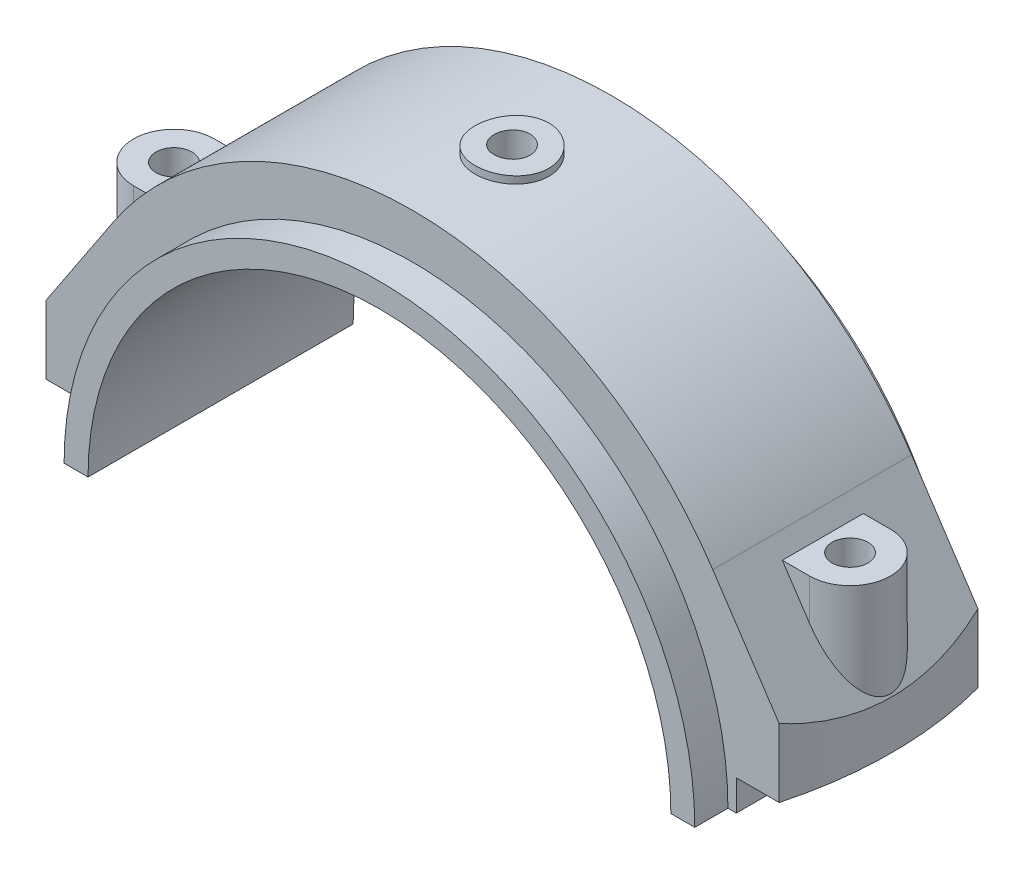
ISO-10303-21;
HEADER;
FILE_DESCRIPTION(('STEP AP214'),'2;1');
FILE_NAME('part.step','',(''),(''),'','','');
FILE_SCHEMA(('AUTOMOTIVE_DESIGN { 1 0 10303 214 1 1 1 1 }'));
ENDSEC;
DATA;
#1=APPLICATION_CONTEXT('core data for automotive mechanical design processes');
#2=APPLICATION_PROTOCOL_DEFINITION('international standard','automotive_design',2000,#1);
#3=PRODUCT_CONTEXT('',#1,'mechanical');
#4=PRODUCT('Part','Part','',(#3));
#5=PRODUCT_RELATED_PRODUCT_CATEGORY('part','',(#4));
#6=PRODUCT_DEFINITION_FORMATION('','',#4);
#7=PRODUCT_DEFINITION_CONTEXT('part definition',#1,'design');
#8=PRODUCT_DEFINITION('design','',#6,#7);
#9=PRODUCT_DEFINITION_SHAPE('','',#8);
#10=(LENGTH_UNIT() NAMED_UNIT(*) SI_UNIT(.MILLI.,.METRE.));
#11=(NAMED_UNIT(*) PLANE_ANGLE_UNIT() SI_UNIT($,.RADIAN.));
#12=(NAMED_UNIT(*) SI_UNIT($,.STERADIAN.) SOLID_ANGLE_UNIT());
#13=UNCERTAINTY_MEASURE_WITH_UNIT(LENGTH_MEASURE(1.E-05),#10,'distance_accuracy_value','');
#14=(GEOMETRIC_REPRESENTATION_CONTEXT(3) GLOBAL_UNCERTAINTY_ASSIGNED_CONTEXT((#13)) GLOBAL_UNIT_ASSIGNED_CONTEXT((#10,
#11,#12)) REPRESENTATION_CONTEXT('',''));
#15=CARTESIAN_POINT('',(0.,0.,0.));
#16=DIRECTION('',(0.,0.,1.));
#17=DIRECTION('',(1.,0.,0.));
#18=AXIS2_PLACEMENT_3D('',#15,#16,#17);
#19=CARTESIAN_POINT('',(48.8478744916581,4.61560526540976,15.));
#20=DIRECTION('',(0.,1.,0.));
#21=DIRECTION('',(-1.,0.,0.));
#22=AXIS2_PLACEMENT_3D('',#19,#20,#21);
#23=PLANE('',#22);
#24=CARTESIAN_POINT('',(51.0067229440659,4.61560526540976,0.));
#25=DIRECTION('',(0.,1.,0.));
#26=DIRECTION('',(-1.,0.,0.));
#27=AXIS2_PLACEMENT_3D('',#24,#25,#26);
#28=CIRCLE('',#27,2.70914530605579);
#29=CARTESIAN_POINT('',(48.8478744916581,4.61560526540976,-1.6367167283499));
#30=VERTEX_POINT('',#29);
#31=CARTESIAN_POINT('',(48.8478744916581,4.61560526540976,1.6367167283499));
#32=VERTEX_POINT('',#31);
#33=EDGE_CURVE('E48',#30,#32,#28,.F.);
#34=ORIENTED_EDGE('',*,*,#33,.F.);
#35=DIRECTION('',(0.,0.,-1.));
#36=VECTOR('',#35,1.);
#37=CARTESIAN_POINT('',(48.8478744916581,4.61560526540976,15.));
#38=LINE('',#37,#36);
#39=CARTESIAN_POINT('',(48.8478744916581,4.61560526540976,-15.));
#40=VERTEX_POINT('',#39);
#41=EDGE_CURVE('E220',#30,#40,#38,.T.);
#42=ORIENTED_EDGE('',*,*,#41,.T.);
#43=DIRECTION('',(1.,0.,0.));
#44=VECTOR('',#43,1.);
#45=CARTESIAN_POINT('',(48.8478744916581,4.61560526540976,-15.));
#46=LINE('',#45,#44);
#47=CARTESIAN_POINT('',(55.3130172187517,4.61560526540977,-15.));
#48=VERTEX_POINT('',#47);
#49=EDGE_CURVE('E413',#40,#48,#46,.T.);
#50=ORIENTED_EDGE('',*,*,#49,.T.);
#51=CARTESIAN_POINT('',(0.,4.61560526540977,0.));
#52=DIRECTION('',(0.,1.,0.));
#53=DIRECTION('',(-1.,0.,0.));
#54=AXIS2_PLACEMENT_3D('',#51,#52,#53);
#55=CIRCLE('',#54,57.3108181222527);
#56=CARTESIAN_POINT('',(55.3130172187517,4.61560526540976,15.));
#57=VERTEX_POINT('',#56);
#58=EDGE_CURVE('E40',#57,#48,#55,.T.);
#59=ORIENTED_EDGE('',*,*,#58,.F.);
#60=DIRECTION('',(1.,0.,0.));
#61=VECTOR('',#60,1.);
#62=CARTESIAN_POINT('',(48.8478744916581,4.61560526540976,15.));
#63=LINE('',#62,#61);
#64=CARTESIAN_POINT('',(48.8478744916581,4.61560526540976,15.));
#65=VERTEX_POINT('',#64);
#66=EDGE_CURVE('E390',#65,#57,#63,.T.);
#67=ORIENTED_EDGE('',*,*,#66,.F.);
#68=EDGE_CURVE('E228',#65,#32,#38,.T.);
#69=ORIENTED_EDGE('',*,*,#68,.T.);
#70=EDGE_LOOP('',(#34,#42,#50,#59,#67,#69));
#71=FACE_BOUND('',#70,.T.);
#72=ADVANCED_FACE('F31',(#71),#23,.F.);
#73=CARTESIAN_POINT('',(43.9719550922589,0.,20.));
#74=DIRECTION('',(0.,1.,0.));
#75=DIRECTION('',(0.,0.,1.));
#76=AXIS2_PLACEMENT_3D('',#73,#74,#75);
#77=PLANE('',#76);
#78=CARTESIAN_POINT('',(51.0067229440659,0.,0.));
#79=DIRECTION('',(0.,1.,0.));
#80=DIRECTION('',(0.,0.,1.));
#81=AXIS2_PLACEMENT_3D('',#78,#79,#80);
#82=CIRCLE('',#81,2.70914530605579);
#83=CARTESIAN_POINT('',(48.8478744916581,0.,-1.6367167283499));
#84=VERTEX_POINT('',#83);
#85=CARTESIAN_POINT('',(48.8478744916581,0.,1.6367167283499));
#86=VERTEX_POINT('',#85);
#87=EDGE_CURVE('E204',#84,#86,#82,.T.);
#88=ORIENTED_EDGE('',*,*,#87,.T.);
#89=DIRECTION('',(0.,0.,-1.));
#90=VECTOR('',#89,1.);
#91=CARTESIAN_POINT('',(48.8478744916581,0.,15.));
#92=LINE('',#91,#90);
#93=CARTESIAN_POINT('',(48.8478744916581,0.,15.));
#94=VERTEX_POINT('',#93);
#95=EDGE_CURVE('E227',#94,#86,#92,.T.);
#96=ORIENTED_EDGE('',*,*,#95,.F.);
#97=DIRECTION('',(1.,0.,0.));
#98=VECTOR('',#97,1.);
#99=CARTESIAN_POINT('',(48.8478744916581,0.,15.));
#100=LINE('',#99,#98);
#101=CARTESIAN_POINT('',(47.5833498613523,0.,15.));
#102=VERTEX_POINT('',#101);
#103=EDGE_CURVE('E385',#102,#94,#100,.T.);
#104=ORIENTED_EDGE('',*,*,#103,.F.);
#105=DIRECTION('',(0.,0.,-1.));
#106=VECTOR('',#105,1.);
#107=CARTESIAN_POINT('',(47.5833498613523,0.,20.));
#108=LINE('',#107,#106);
#109=CARTESIAN_POINT('',(47.5833498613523,0.,20.));
#110=VERTEX_POINT('',#109);
#111=EDGE_CURVE('E254',#110,#102,#108,.T.);
#112=ORIENTED_EDGE('',*,*,#111,.F.);
#113=DIRECTION('',(1.,0.,0.));
#114=VECTOR('',#113,1.);
#115=CARTESIAN_POINT('',(43.9719550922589,0.,20.));
#116=LINE('',#115,#114);
#117=CARTESIAN_POINT('',(43.9719550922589,0.,20.));
#118=VERTEX_POINT('',#117);
#119=EDGE_CURVE('E243',#118,#110,#116,.T.);
#120=ORIENTED_EDGE('',*,*,#119,.F.);
#121=DIRECTION('',(0.,0.,-1.));
#122=VECTOR('',#121,1.);
#123=CARTESIAN_POINT('',(43.9719550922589,0.,20.));
#124=LINE('',#123,#122);
#125=CARTESIAN_POINT('',(43.9719550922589,0.,-20.));
#126=VERTEX_POINT('',#125);
#127=EDGE_CURVE('E256',#118,#126,#124,.T.);
#128=ORIENTED_EDGE('',*,*,#127,.T.);
#129=DIRECTION('',(1.,0.,0.));
#130=VECTOR('',#129,1.);
#131=CARTESIAN_POINT('',(43.9719550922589,0.,-20.));
#132=LINE('',#131,#130);
#133=CARTESIAN_POINT('',(47.5833498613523,0.,-20.));
#134=VERTEX_POINT('',#133);
#135=EDGE_CURVE('E239',#126,#134,#132,.T.);
#136=ORIENTED_EDGE('',*,*,#135,.T.);
#137=CARTESIAN_POINT('',(47.5833498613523,0.,-15.));
#138=VERTEX_POINT('',#137);
#139=EDGE_CURVE('E245',#138,#134,#108,.T.);
#140=ORIENTED_EDGE('',*,*,#139,.F.);
#141=DIRECTION('',(1.,0.,0.));
#142=VECTOR('',#141,1.);
#143=CARTESIAN_POINT('',(48.8478744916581,0.,-15.));
#144=LINE('',#143,#142);
#145=CARTESIAN_POINT('',(48.8478744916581,0.,-15.));
#146=VERTEX_POINT('',#145);
#147=EDGE_CURVE('E225',#138,#146,#144,.T.);
#148=ORIENTED_EDGE('',*,*,#147,.T.);
#149=EDGE_CURVE('E218',#84,#146,#92,.T.);
#150=ORIENTED_EDGE('',*,*,#149,.F.);
#151=EDGE_LOOP('',(#88,#96,#104,#112,#120,#128,#136,#140,#148,#150));
#152=FACE_BOUND('',#151,.T.);
#153=ADVANCED_FACE('F223',(#152),#77,.F.);
#154=CARTESIAN_POINT('',(48.8478744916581,0.,15.));
#155=DIRECTION('',(-1.,0.,0.));
#156=DIRECTION('',(0.,0.,1.));
#157=AXIS2_PLACEMENT_3D('',#154,#155,#156);
#158=PLANE('',#157);
#159=DIRECTION('',(0.,-1.,0.));
#160=VECTOR('',#159,1.);
#161=CARTESIAN_POINT('',(48.8478744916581,69.5,-1.6367167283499));
#162=LINE('',#161,#160);
#163=EDGE_CURVE('E207',#84,#30,#162,.F.);
#164=ORIENTED_EDGE('',*,*,#163,.F.);
#165=ORIENTED_EDGE('',*,*,#149,.T.);
#166=DIRECTION('',(0.,1.,0.));
#167=VECTOR('',#166,1.);
#168=CARTESIAN_POINT('',(48.8478744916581,0.,-15.));
#169=LINE('',#168,#167);
#170=EDGE_CURVE('E411',#146,#40,#169,.T.);
#171=ORIENTED_EDGE('',*,*,#170,.T.);
#172=ORIENTED_EDGE('',*,*,#41,.F.);
#173=EDGE_LOOP('',(#164,#165,#171,#172));
#174=FACE_BOUND('',#173,.T.);
#175=ADVANCED_FACE('F216',(#174),#158,.F.);
#176=DIRECTION('',(0.,-1.,0.));
#177=VECTOR('',#176,1.);
#178=CARTESIAN_POINT('',(48.8478744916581,69.5,1.6367167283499));
#179=LINE('',#178,#177);
#180=EDGE_CURVE('E208',#32,#86,#179,.T.);
#181=ORIENTED_EDGE('',*,*,#180,.F.);
#182=ORIENTED_EDGE('',*,*,#68,.F.);
#183=DIRECTION('',(0.,1.,0.));
#184=VECTOR('',#183,1.);
#185=CARTESIAN_POINT('',(48.8478744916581,0.,15.));
#186=LINE('',#185,#184);
#187=EDGE_CURVE('E388',#94,#65,#186,.T.);
#188=ORIENTED_EDGE('',*,*,#187,.F.);
#189=ORIENTED_EDGE('',*,*,#95,.T.);
#190=EDGE_LOOP('',(#181,#182,#188,#189));
#191=FACE_BOUND('',#190,.T.);
#192=ADVANCED_FACE('F465',(#191),#158,.F.);
#193=CARTESIAN_POINT('',(51.0067229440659,27.6156052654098,0.));
#194=DIRECTION('',(0.,-1.,0.));
#195=DIRECTION('',(1.,0.,0.));
#196=AXIS2_PLACEMENT_3D('',#193,#194,#195);
#197=PLANE('',#196);
#198=DIRECTION('',(-1.,0.,0.));
#199=VECTOR('',#198,1.);
#200=CARTESIAN_POINT('',(51.0067229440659,27.6156052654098,-6.10746715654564));
#201=LINE('',#200,#199);
#202=CARTESIAN_POINT('',(51.0067229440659,27.6156052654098,-6.10746715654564));
#203=VERTEX_POINT('',#202);
#204=CARTESIAN_POINT('',(46.8976558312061,27.6156052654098,-6.10746715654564));
#205=VERTEX_POINT('',#204);
#206=EDGE_CURVE('E352',#203,#205,#201,.T.);
#207=ORIENTED_EDGE('',*,*,#206,.T.);
#208=DIRECTION('',(0.,0.,1.));
#209=VECTOR('',#208,1.);
#210=CARTESIAN_POINT('',(46.8976558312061,27.6156052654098,15.));
#211=LINE('',#210,#209);
#212=CARTESIAN_POINT('',(46.8976558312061,27.6156052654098,6.10746715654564));
#213=VERTEX_POINT('',#212);
#214=EDGE_CURVE('E269',#205,#213,#211,.T.);
#215=ORIENTED_EDGE('',*,*,#214,.T.);
#216=DIRECTION('',(1.,0.,0.));
#217=VECTOR('',#216,1.);
#218=CARTESIAN_POINT('',(44.8992557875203,27.6156052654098,6.10746715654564));
#219=LINE('',#218,#217);
#220=CARTESIAN_POINT('',(51.0067229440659,27.6156052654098,6.10746715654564));
#221=VERTEX_POINT('',#220);
#222=EDGE_CURVE('E348',#213,#221,#219,.T.);
#223=ORIENTED_EDGE('',*,*,#222,.T.);
#224=CARTESIAN_POINT('',(51.0067229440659,27.6156052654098,0.));
#225=DIRECTION('',(0.,1.,0.));
#226=DIRECTION('',(1.,0.,0.));
#227=AXIS2_PLACEMENT_3D('',#224,#225,#226);
#228=CIRCLE('',#227,6.10746715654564);
#229=EDGE_CURVE('E350',#221,#203,#228,.T.);
#230=ORIENTED_EDGE('',*,*,#229,.T.);
#231=EDGE_LOOP('',(#207,#215,#223,#230));
#232=FACE_BOUND('',#231,.T.);
#233=CARTESIAN_POINT('',(51.0067229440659,27.6156052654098,0.));
#234=DIRECTION('',(0.,-1.,0.));
#235=DIRECTION('',(1.,0.,0.));
#236=AXIS2_PLACEMENT_3D('',#233,#234,#235);
#237=CIRCLE('',#236,2.70914530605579);
#238=CARTESIAN_POINT('',(53.7158682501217,27.6156052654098,0.));
#239=VERTEX_POINT('',#238);
#240=EDGE_CURVE('E35',#239,#239,#237,.F.);
#241=ORIENTED_EDGE('',*,*,#240,.F.);
#242=EDGE_LOOP('',(#241));
#243=FACE_BOUND('',#242,.T.);
#244=ADVANCED_FACE('F496',(#232,#243),#197,.F.);
#245=CARTESIAN_POINT('',(0.,0.,20.));
#246=DIRECTION('',(0.,0.,-1.));
#247=DIRECTION('',(-1.,0.,0.));
#248=AXIS2_PLACEMENT_3D('',#245,#246,#247);
#249=CYLINDRICAL_SURFACE('',#248,43.9719550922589);
#250=CARTESIAN_POINT('',(0.,0.,-20.));
#251=DIRECTION('',(0.,0.,-1.));
#252=DIRECTION('',(1.,0.,0.));
#253=AXIS2_PLACEMENT_3D('',#250,#251,#252);
#254=CIRCLE('',#253,43.9719550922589);
#255=CARTESIAN_POINT('',(-43.9719550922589,0.,-20.));
#256=VERTEX_POINT('',#255);
#257=EDGE_CURVE('E250',#256,#126,#254,.T.);
#258=ORIENTED_EDGE('',*,*,#257,.T.);
#259=ORIENTED_EDGE('',*,*,#127,.F.);
#260=CARTESIAN_POINT('',(0.,0.,20.));
#261=DIRECTION('',(0.,0.,-1.));
#262=DIRECTION('',(1.,0.,0.));
#263=AXIS2_PLACEMENT_3D('',#260,#261,#262);
#264=CIRCLE('',#263,43.9719550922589);
#265=CARTESIAN_POINT('',(-43.9719550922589,0.,20.));
#266=VERTEX_POINT('',#265);
#267=EDGE_CURVE('E241',#266,#118,#264,.T.);
#268=ORIENTED_EDGE('',*,*,#267,.F.);
#269=DIRECTION('',(0.,0.,-1.));
#270=VECTOR('',#269,1.);
#271=CARTESIAN_POINT('',(-43.9719550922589,0.,20.));
#272=LINE('',#271,#270);
#273=EDGE_CURVE('E259',#266,#256,#272,.T.);
#274=ORIENTED_EDGE('',*,*,#273,.T.);
#275=EDGE_LOOP('',(#258,#259,#268,#274));
#276=FACE_BOUND('',#275,.T.);
#277=CARTESIAN_POINT('',(0.,43.9719550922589,-2.70914530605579));
#278=CARTESIAN_POINT('',(0.152019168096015,43.9719539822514,-2.70913861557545));
#279=CARTESIAN_POINT('',(0.304144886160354,43.971158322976,-2.69630685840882));
#280=CARTESIAN_POINT('',(0.604196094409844,43.9680607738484,-2.6453024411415));
#281=CARTESIAN_POINT('',(0.752116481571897,43.9657571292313,-2.60710025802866));
#282=CARTESIAN_POINT('',(1.03936731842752,43.9599042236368,-2.50645613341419));
#283=CARTESIAN_POINT('',(1.17870224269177,43.9563556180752,-2.44402694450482));
#284=CARTESIAN_POINT('',(1.44487871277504,43.9484119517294,-2.29672153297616));
#285=CARTESIAN_POINT('',(1.57172311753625,43.9440170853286,-2.21185046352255));
#286=CARTESIAN_POINT('',(1.80953956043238,43.9348677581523,-2.02193459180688));
#287=CARTESIAN_POINT('',(1.92049097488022,43.9301128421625,-1.91686398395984));
#288=CARTESIAN_POINT('',(2.12319560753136,43.9207832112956,-1.68958468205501));
#289=CARTESIAN_POINT('',(2.21494802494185,43.9162085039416,-1.56737527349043));
#290=CARTESIAN_POINT('',(2.37671329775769,43.9077516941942,-1.30917117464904));
#291=CARTESIAN_POINT('',(2.44670908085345,43.9038701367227,-1.17316576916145));
#292=CARTESIAN_POINT('',(2.56286490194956,43.8972432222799,-0.891305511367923));
#293=CARTESIAN_POINT('',(2.60902519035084,43.8944978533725,-0.745450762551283));
#294=CARTESIAN_POINT('',(2.67614262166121,43.8904572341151,-0.448230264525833));
#295=CARTESIAN_POINT('',(2.69713198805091,43.8891601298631,-0.296871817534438));
#296=CARTESIAN_POINT('',(2.71341123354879,43.8881567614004,0.00722512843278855));
#297=CARTESIAN_POINT('',(2.70870139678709,43.8884504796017,0.15996361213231));
#298=CARTESIAN_POINT('',(2.67374267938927,43.8905939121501,0.462265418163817));
#299=CARTESIAN_POINT('',(2.64352866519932,43.8924415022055,0.611832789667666));
#300=CARTESIAN_POINT('',(2.55847333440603,43.8974811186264,0.903768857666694));
#301=CARTESIAN_POINT('',(2.50363187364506,43.9006731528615,1.0461375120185));
#302=CARTESIAN_POINT('',(2.37083879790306,43.9080443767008,1.31974685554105));
#303=CARTESIAN_POINT('',(2.29287136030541,43.9122242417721,1.45097984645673));
#304=CARTESIAN_POINT('',(2.11605101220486,43.9210994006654,1.69850847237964));
#305=CARTESIAN_POINT('',(2.0171978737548,43.9257947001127,1.81480394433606));
#306=CARTESIAN_POINT('',(1.80121579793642,43.9351810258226,2.02935919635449));
#307=CARTESIAN_POINT('',(1.68405668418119,43.9398720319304,2.12758860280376));
#308=CARTESIAN_POINT('',(1.43489418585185,43.9487135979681,2.30298908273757));
#309=CARTESIAN_POINT('',(1.30289079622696,43.9528641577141,2.38016014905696));
#310=CARTESIAN_POINT('',(1.02776846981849,43.9601574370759,2.51125074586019));
#311=CARTESIAN_POINT('',(0.88464898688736,43.9633001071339,2.56516913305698));
#312=CARTESIAN_POINT('',(0.591365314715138,43.9682227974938,2.64820356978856));
#313=CARTESIAN_POINT('',(0.441201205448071,43.9700028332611,2.67731990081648));
#314=CARTESIAN_POINT('',(0.138354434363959,43.9719976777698,2.7098860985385));
#315=CARTESIAN_POINT('',(-0.014323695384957,43.9722150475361,2.71337796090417));
#316=CARTESIAN_POINT('',(-0.318096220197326,43.97106687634,2.69470581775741));
#317=CARTESIAN_POINT('',(-0.469190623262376,43.969701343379,2.67254194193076));
#318=CARTESIAN_POINT('',(-0.765388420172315,43.965542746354,2.60322224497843));
#319=CARTESIAN_POINT('',(-0.91049633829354,43.9627507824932,2.55608568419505));
#320=CARTESIAN_POINT('',(-1.19074170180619,43.9560534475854,2.43817821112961));
#321=CARTESIAN_POINT('',(-1.32587906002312,43.9521480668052,2.36740709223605));
#322=CARTESIAN_POINT('',(-1.58253960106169,43.9436563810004,2.20413248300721));
#323=CARTESIAN_POINT('',(-1.7040449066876,43.9390691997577,2.11160093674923));
#324=CARTESIAN_POINT('',(-1.9298123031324,43.9297331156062,1.90747295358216));
#325=CARTESIAN_POINT('',(-2.0340742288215,43.9249842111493,1.79587633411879));
#326=CARTESIAN_POINT('',(-2.22253743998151,43.9158525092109,1.5566048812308));
#327=CARTESIAN_POINT('',(-2.30671148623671,43.9114702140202,1.42890857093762));
#328=CARTESIAN_POINT('',(-2.45242323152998,43.9035739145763,1.16117055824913));
#329=CARTESIAN_POINT('',(-2.5139610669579,43.9000599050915,1.02112893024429));
#330=CARTESIAN_POINT('',(-2.61260636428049,43.8943000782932,0.732775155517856));
#331=CARTESIAN_POINT('',(-2.64973098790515,43.8920533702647,0.584468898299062));
#332=CARTESIAN_POINT('',(-2.69855208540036,43.8890790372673,0.283713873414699));
#333=CARTESIAN_POINT('',(-2.71024880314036,43.8883513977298,0.131265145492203));
#334=CARTESIAN_POINT('',(-2.70787971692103,43.8884976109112,-0.173176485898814));
#335=CARTESIAN_POINT('',(-2.69385673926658,43.8893688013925,-0.325169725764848));
#336=CARTESIAN_POINT('',(-2.64053509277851,43.8926088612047,-0.624639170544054));
#337=CARTESIAN_POINT('',(-2.60123637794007,43.8949777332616,-0.772115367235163));
#338=CARTESIAN_POINT('',(-2.49848837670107,43.900945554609,-1.05837106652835));
#339=CARTESIAN_POINT('',(-2.43503923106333,43.9045444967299,-1.19715061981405));
#340=CARTESIAN_POINT('',(-2.28579744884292,43.9125668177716,-1.46209254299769));
#341=CARTESIAN_POINT('',(-2.20000539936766,43.9169901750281,-1.58825524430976));
#342=CARTESIAN_POINT('',(-2.00835511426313,43.9261714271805,-1.82459913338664));
#343=CARTESIAN_POINT('',(-1.90246598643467,43.9309298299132,-1.93475525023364));
#344=CARTESIAN_POINT('',(-1.67366754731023,43.9402406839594,-2.13576585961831));
#345=CARTESIAN_POINT('',(-1.55075407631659,43.9447930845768,-2.22661562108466));
#346=CARTESIAN_POINT('',(-1.2912595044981,43.953183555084,-2.38649959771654));
#347=CARTESIAN_POINT('',(-1.15466197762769,43.9570207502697,-2.45550717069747));
#348=CARTESIAN_POINT('',(-0.871895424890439,43.963536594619,-2.56952400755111));
#349=CARTESIAN_POINT('',(-0.725737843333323,43.9662166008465,-2.61456139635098));
#350=CARTESIAN_POINT('',(-0.482237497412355,43.9694132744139,-2.66764542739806));
#351=CARTESIAN_POINT('',(-0.386468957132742,43.9703622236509,-2.68318777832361));
#352=CARTESIAN_POINT('',(-0.193814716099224,43.9716334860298,-2.70393984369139));
#353=CARTESIAN_POINT('',(-0.0969290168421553,43.9719558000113,-2.70914957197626));
#354=CARTESIAN_POINT('',(0.,43.9719550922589,-2.70914530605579));
#355=B_SPLINE_CURVE_WITH_KNOTS('',3,(#277,#278,#279,#280,#281,#282,#283,#284,#285,#286,#287,
#288,#289,#290,#291,#292,#293,#294,#295,#296,#297,#298,#299,#300,#301,#302,#303,#304,#305,#306,
#307,#308,#309,#310,#311,#312,#313,#314,#315,#316,#317,#318,#319,#320,#321,#322,#323,#324,#325,
#326,#327,#328,#329,#330,#331,#332,#333,#334,#335,#336,#337,#338,#339,#340,#341,#342,#343,#344,
#345,#346,#347,#348,#349,#350,#351,#352,#353,#354),.UNSPECIFIED.,.T.,.F.,(4,2,2,2,2,2,2,2,2,2,2,
2,2,2,2,2,2,2,2,2,2,2,2,2,2,2,2,2,2,2,2,2,2,2,2,2,2,2,4),(0.,0.455703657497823,
0.911938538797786,1.36793359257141,1.8238240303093,2.28030080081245,2.73679660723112,
3.19364972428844,3.65049804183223,4.10676088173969,4.56301867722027,5.01865373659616,
5.47429146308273,5.93024165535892,6.38619682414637,6.84291169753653,7.29962672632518,
7.7563642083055,8.21309650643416,8.66908010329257,9.1250613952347,9.58069151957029,
10.0363256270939,10.4925504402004,10.9487796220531,11.4056239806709,11.8624655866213,
12.3189857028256,12.7755014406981,13.2312577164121,13.6870148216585,14.1427692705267,
14.5985117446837,15.0549605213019,15.5115210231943,15.9686362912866,16.4252140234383,
16.7157758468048,17.0063372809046),.UNSPECIFIED.);
#356=CARTESIAN_POINT('',(0.,43.9719550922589,-2.70914530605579));
#357=VERTEX_POINT('',#356);
#358=EDGE_CURVE('E470',#357,#357,#355,.T.);
#359=ORIENTED_EDGE('',*,*,#358,.F.);
#360=EDGE_LOOP('',(#359));
#361=FACE_BOUND('',#360,.T.);
#362=ADVANCED_FACE('F478',(#276,#361),#249,.F.);
#363=CARTESIAN_POINT('',(0.,11.5,20.));
#364=DIRECTION('',(0.,0.,-1.));
#365=DIRECTION('',(-1.,0.,0.));
#366=AXIS2_PLACEMENT_3D('',#363,#364,#365);
#367=CYLINDRICAL_SURFACE('',#366,43.9719550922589);
#368=CARTESIAN_POINT('',(0.,55.4719550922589,-5.5647308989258));
#369=CARTESIAN_POINT('',(0.0918841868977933,55.4719554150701,-5.56473283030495));
#370=CARTESIAN_POINT('',(0.183765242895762,55.4716266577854,-5.56237547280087));
#371=CARTESIAN_POINT('',(0.367073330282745,55.4703464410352,-5.55301613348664));
#372=CARTESIAN_POINT('',(0.458500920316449,55.4693964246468,-5.5460249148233));
#373=CARTESIAN_POINT('',(0.640715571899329,55.4669110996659,-5.5274881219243));
#374=CARTESIAN_POINT('',(0.731503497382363,55.4653768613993,-5.51595087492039));
#375=CARTESIAN_POINT('',(0.912254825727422,55.4617608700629,-5.4884145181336));
#376=CARTESIAN_POINT('',(1.00221922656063,55.459679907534,-5.47242184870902));
#377=CARTESIAN_POINT('',(1.18113903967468,55.4550080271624,-5.4360658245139));
#378=CARTESIAN_POINT('',(1.27009548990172,55.4524176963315,-5.41570749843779));
#379=CARTESIAN_POINT('',(1.44681516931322,55.4467646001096,-5.37071107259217));
#380=CARTESIAN_POINT('',(1.53457943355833,55.4437022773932,-5.34607698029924));
#381=CARTESIAN_POINT('',(1.70873048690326,55.43714265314,-5.29261949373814));
#382=CARTESIAN_POINT('',(1.79511830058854,55.4336456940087,-5.26379939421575));
#383=CARTESIAN_POINT('',(1.96633220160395,55.4262542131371,-5.20206007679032));
#384=CARTESIAN_POINT('',(2.0511593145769,55.4223599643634,-5.16914366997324));
#385=CARTESIAN_POINT('',(2.21906753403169,55.4142112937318,-5.09930169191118));
#386=CARTESIAN_POINT('',(2.30214968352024,55.4099570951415,-5.06237860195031));
#387=CARTESIAN_POINT('',(2.4663836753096,55.4011258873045,-4.98461306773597));
#388=CARTESIAN_POINT('',(2.54753658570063,55.3965490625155,-4.94377285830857));
#389=CARTESIAN_POINT('',(2.70772776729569,55.3871099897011,-4.85826279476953));
#390=CARTESIAN_POINT('',(2.78676711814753,55.3822478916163,-4.81359494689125));
#391=CARTESIAN_POINT('',(2.94254692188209,55.3722755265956,-4.72051937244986));
#392=CARTESIAN_POINT('',(3.01928841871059,55.3671653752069,-4.67211338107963));
#393=CARTESIAN_POINT('',(3.17028806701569,55.356734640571,-4.5716510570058));
#394=CARTESIAN_POINT('',(3.24454713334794,55.3514141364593,-4.51959609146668));
#395=CARTESIAN_POINT('',(3.39039844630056,55.3405986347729,-4.41192646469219));
#396=CARTESIAN_POINT('',(3.46199132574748,55.3351036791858,-4.35631265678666));
#397=CARTESIAN_POINT('',(3.60232367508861,55.3239819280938,-4.24161235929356));
#398=CARTESIAN_POINT('',(3.67106327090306,55.3183551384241,-4.18252602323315));
#399=CARTESIAN_POINT('',(3.80551490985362,55.3069873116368,-4.06098195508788));
#400=CARTESIAN_POINT('',(3.87122626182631,55.3012462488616,-3.99852346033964));
#401=CARTESIAN_POINT('',(3.99938925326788,55.2897621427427,-3.87029673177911));
#402=CARTESIAN_POINT('',(4.06183960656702,55.2840190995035,-3.80452721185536));
#403=CARTESIAN_POINT('',(4.18334518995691,55.2726436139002,-3.66985656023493));
#404=CARTESIAN_POINT('',(4.24239871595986,55.2670112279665,-3.60095388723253));
#405=CARTESIAN_POINT('',(4.35703377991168,55.2558750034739,-3.46023611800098));
#406=CARTESIAN_POINT('',(4.4126130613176,55.2503712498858,-3.38841917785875));
#407=CARTESIAN_POINT('',(4.5202097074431,55.2395353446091,-3.24207787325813));
#408=CARTESIAN_POINT('',(4.57222462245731,55.2342033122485,-3.16755169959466));
#409=CARTESIAN_POINT('',(4.6726056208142,55.223747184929,-3.01600029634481));
#410=CARTESIAN_POINT('',(4.72096938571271,55.2186232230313,-2.93897352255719));
#411=CARTESIAN_POINT('',(4.813959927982,55.2086213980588,-2.78262809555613));
#412=CARTESIAN_POINT('',(4.85858478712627,55.2037436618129,-2.70330829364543));
#413=CARTESIAN_POINT('',(4.94400932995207,55.1942719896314,-2.54258413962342));
#414=CARTESIAN_POINT('',(4.98480770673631,55.1896781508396,-2.46117908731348));
#415=CARTESIAN_POINT('',(5.06249081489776,55.1808121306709,-2.29649165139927));
#416=CARTESIAN_POINT('',(5.09937499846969,55.1765399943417,-2.21320900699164));
#417=CARTESIAN_POINT('',(5.16914111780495,55.1683552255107,-2.04497364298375));
#418=CARTESIAN_POINT('',(5.20202334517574,55.1644425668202,-1.96002104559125));
#419=CARTESIAN_POINT('',(5.26369685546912,55.1570146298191,-1.78865308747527));
#420=CARTESIAN_POINT('',(5.29248927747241,55.1534992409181,-1.70223814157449));
#421=CARTESIAN_POINT('',(5.34589449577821,55.1469037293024,-1.52815289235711));
#422=CARTESIAN_POINT('',(5.37050920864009,55.1438234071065,-1.44048318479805));
#423=CARTESIAN_POINT('',(5.41547030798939,55.1381359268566,-1.26409592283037));
#424=CARTESIAN_POINT('',(5.43581923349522,55.1355284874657,-1.17537902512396));
#425=CARTESIAN_POINT('',(5.47216054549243,55.1308246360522,-0.99710502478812));
#426=CARTESIAN_POINT('',(5.4881558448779,55.1287278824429,-0.907548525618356));
#427=CARTESIAN_POINT('',(5.5157007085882,55.1250833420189,-0.727803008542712));
#428=CARTESIAN_POINT('',(5.52725320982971,55.1235351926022,-0.637614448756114));
#429=CARTESIAN_POINT('',(5.54582824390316,55.1210253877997,-0.456812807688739));
#430=CARTESIAN_POINT('',(5.55285327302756,55.1200634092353,-0.366199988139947));
#431=CARTESIAN_POINT('',(5.56227242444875,55.1187647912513,-0.184757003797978));
#432=CARTESIAN_POINT('',(5.56466802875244,55.1184279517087,-0.0939269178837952));
#433=CARTESIAN_POINT('',(5.56479202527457,55.1184132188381,0.087703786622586));
#434=CARTESIAN_POINT('',(5.56252204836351,55.1187350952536,0.178504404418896));
#435=CARTESIAN_POINT('',(5.55343497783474,55.1199975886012,0.359842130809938));
#436=CARTESIAN_POINT('',(5.54661937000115,55.1209380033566,0.45037931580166));
#437=CARTESIAN_POINT('',(5.5285006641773,55.1234020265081,0.630996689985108));
#438=CARTESIAN_POINT('',(5.51719747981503,55.124925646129,0.721076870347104));
#439=CARTESIAN_POINT('',(5.490179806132,55.1285192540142,0.900586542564));
#440=CARTESIAN_POINT('',(5.47446411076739,55.1305893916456,0.990015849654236));
#441=CARTESIAN_POINT('',(5.43869257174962,55.1352396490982,1.16803023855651));
#442=CARTESIAN_POINT('',(5.41863476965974,55.1378199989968,1.25661492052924));
#443=CARTESIAN_POINT('',(5.37425103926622,55.1434542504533,1.43274651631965));
#444=CARTESIAN_POINT('',(5.34992268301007,55.1465084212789,1.52029280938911));
#445=CARTESIAN_POINT('',(5.29706926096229,55.1530539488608,1.69415408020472));
#446=CARTESIAN_POINT('',(5.26854149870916,55.1565455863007,1.78046822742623));
#447=CARTESIAN_POINT('',(5.20736057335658,55.1639297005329,1.95167163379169));
#448=CARTESIAN_POINT('',(5.17470457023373,55.1678224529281,2.03655986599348));
#449=CARTESIAN_POINT('',(5.10533832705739,55.175972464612,2.20471784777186));
#450=CARTESIAN_POINT('',(5.0686251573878,55.1802299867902,2.28798637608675));
#451=CARTESIAN_POINT('',(4.99121570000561,55.1890732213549,2.45271134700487));
#452=CARTESIAN_POINT('',(4.95051638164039,55.1936591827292,2.53416635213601));
#453=CARTESIAN_POINT('',(4.8652057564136,55.2031229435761,2.69507069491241));
#454=CARTESIAN_POINT('',(4.82059124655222,55.2080009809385,2.77451832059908));
#455=CARTESIAN_POINT('',(4.72752144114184,55.2180126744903,2.9312143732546));
#456=CARTESIAN_POINT('',(4.6790626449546,55.2231465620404,3.0084607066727));
#457=CARTESIAN_POINT('',(4.57837558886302,55.2336332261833,3.16056078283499));
#458=CARTESIAN_POINT('',(4.52614335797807,55.2389862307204,3.23541188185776));
#459=CARTESIAN_POINT('',(4.41798094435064,55.2498762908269,3.38252816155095));
#460=CARTESIAN_POINT('',(4.36204610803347,55.2554135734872,3.45478990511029));
#461=CARTESIAN_POINT('',(4.24655013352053,55.2666302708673,3.59653480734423));
#462=CARTESIAN_POINT('',(4.1869834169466,55.2723098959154,3.66601340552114));
#463=CARTESIAN_POINT('',(4.0642958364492,55.2837958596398,3.80199815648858));
#464=CARTESIAN_POINT('',(4.00116821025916,55.2896024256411,3.86849819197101));
#465=CARTESIAN_POINT('',(3.87159245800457,55.3012131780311,3.99817577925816));
#466=CARTESIAN_POINT('',(3.80514445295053,55.3070173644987,4.06135345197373));
#467=CARTESIAN_POINT('',(3.66926810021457,55.3184944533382,4.18414251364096));
#468=CARTESIAN_POINT('',(3.59984608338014,55.3241675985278,4.24376088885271));
#469=CARTESIAN_POINT('',(3.4582167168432,55.335367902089,4.35936077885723));
#470=CARTESIAN_POINT('',(3.38601410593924,55.3408952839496,4.41534807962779));
#471=CARTESIAN_POINT('',(3.23901771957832,55.3517627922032,4.52361649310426));
#472=CARTESIAN_POINT('',(3.16422752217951,55.3571031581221,4.57590244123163));
#473=CARTESIAN_POINT('',(3.01224980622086,55.3675624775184,4.67669814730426));
#474=CARTESIAN_POINT('',(2.93506503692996,55.3726816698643,4.72521202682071));
#475=CARTESIAN_POINT('',(2.77849168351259,55.3826625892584,4.81839345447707));
#476=CARTESIAN_POINT('',(2.69910526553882,55.3875245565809,4.86306461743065));
#477=CARTESIAN_POINT('',(2.53832189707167,55.3969554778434,4.9484902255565));
#478=CARTESIAN_POINT('',(2.45692670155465,55.4015246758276,4.98924794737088));
#479=CARTESIAN_POINT('',(2.29231889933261,55.4103343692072,5.06677612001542));
#480=CARTESIAN_POINT('',(2.20910774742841,55.4145751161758,5.10354963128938));
#481=CARTESIAN_POINT('',(2.04106105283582,55.4226922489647,5.17303869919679));
#482=CARTESIAN_POINT('',(1.95622672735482,55.4265688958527,5.20575716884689));
#483=CARTESIAN_POINT('',(1.78512664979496,55.4339221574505,5.26706540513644));
#484=CARTESIAN_POINT('',(1.6988619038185,55.4373990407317,5.29565794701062));
#485=CARTESIAN_POINT('',(1.52509392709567,55.4439171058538,5.34864354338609));
#486=CARTESIAN_POINT('',(1.43759149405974,55.4469585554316,5.3730391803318));
#487=CARTESIAN_POINT('',(1.26154108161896,55.4525700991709,5.4175603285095));
#488=CARTESIAN_POINT('',(1.17299368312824,55.4551404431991,5.43768810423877));
#489=CARTESIAN_POINT('',(0.995046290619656,55.4597741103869,5.47360267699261));
#490=CARTESIAN_POINT('',(0.905646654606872,55.4618376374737,5.48939122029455));
#491=CARTESIAN_POINT('',(0.726187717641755,55.4654221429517,5.51655794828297));
#492=CARTESIAN_POINT('',(0.636128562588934,55.4669432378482,5.52793708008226));
#493=CARTESIAN_POINT('',(0.455543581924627,55.469406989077,5.54621114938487));
#494=CARTESIAN_POINT('',(0.365017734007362,55.4703496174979,5.55310587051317));
#495=CARTESIAN_POINT('',(0.183692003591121,55.4716221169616,5.56235534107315));
#496=CARTESIAN_POINT('',(0.0928920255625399,55.4719517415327,5.56470826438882));
#497=CARTESIAN_POINT('',(-0.0887450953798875,55.4719583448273,5.56475275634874));
#498=CARTESIAN_POINT('',(-0.179582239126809,55.4716350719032,5.56244252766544));
#499=CARTESIAN_POINT('',(-0.361043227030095,55.4703681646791,5.55319399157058));
#500=CARTESIAN_POINT('',(-0.4516669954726,55.4694243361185,5.54625423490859));
#501=CARTESIAN_POINT('',(-0.632494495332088,55.4669547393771,5.52784956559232));
#502=CARTESIAN_POINT('',(-0.72269797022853,55.4654286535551,5.5163821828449));
#503=CARTESIAN_POINT('',(-0.90247736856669,55.4618313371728,5.48900673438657));
#504=CARTESIAN_POINT('',(-0.992052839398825,55.4597597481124,5.47309574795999));
#505=CARTESIAN_POINT('',(-1.17036892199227,55.4551085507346,5.43692176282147));
#506=CARTESIAN_POINT('',(-1.25910893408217,55.4525286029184,5.41665585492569));
#507=CARTESIAN_POINT('',(-1.43554665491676,55.4468976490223,5.37185897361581));
#508=CARTESIAN_POINT('',(-1.52324370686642,55.4438463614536,5.34732545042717));
#509=CARTESIAN_POINT('',(-1.69738796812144,55.4373096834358,5.29408028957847));
#510=CARTESIAN_POINT('',(-1.7838345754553,55.4338240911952,5.26536670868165));
#511=CARTESIAN_POINT('',(-1.95527027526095,55.4264557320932,5.20384805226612));
#512=CARTESIAN_POINT('',(-2.04025893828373,55.4225728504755,5.17104179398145));
#513=CARTESIAN_POINT('',(-2.2085709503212,55.4144468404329,5.10142427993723));
#514=CARTESIAN_POINT('',(-2.29189415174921,55.4102036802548,5.06461267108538));
#515=CARTESIAN_POINT('',(-2.45666731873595,55.4013940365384,4.98707087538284));
#516=CARTESIAN_POINT('',(-2.53811750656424,55.3968275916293,4.94634115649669));
#517=CARTESIAN_POINT('',(-2.69893665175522,55.3874083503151,4.8610495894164));
#518=CARTESIAN_POINT('',(-2.77830625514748,55.3825556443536,4.81648894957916));
#519=CARTESIAN_POINT('',(-2.93475610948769,55.3726007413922,4.72362200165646));
#520=CARTESIAN_POINT('',(-3.01183743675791,55.3674986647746,4.67531749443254));
#521=CARTESIAN_POINT('',(-3.16350288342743,55.3570823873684,4.57504966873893));
#522=CARTESIAN_POINT('',(-3.23808845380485,55.3517683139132,4.52308853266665));
#523=CARTESIAN_POINT('',(-3.3845535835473,55.3409636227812,4.41559358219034));
#524=CARTESIAN_POINT('',(-3.45643483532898,55.3354731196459,4.36006206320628));
#525=CARTESIAN_POINT('',(-3.59728643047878,55.3243579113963,4.24551622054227));
#526=CARTESIAN_POINT('',(-3.66625847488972,55.3187332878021,4.18650398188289));
#527=CARTESIAN_POINT('',(-3.80107297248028,55.3073670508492,4.06507393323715));
#528=CARTESIAN_POINT('',(-3.86691679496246,55.3016254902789,4.00265763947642));
#529=CARTESIAN_POINT('',(-3.99529302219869,55.2901377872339,3.87456119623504));
#530=CARTESIAN_POINT('',(-4.0578267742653,55.284391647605,3.80888239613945));
#531=CARTESIAN_POINT('',(-4.17951789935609,55.2730083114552,3.67449917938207));
#532=CARTESIAN_POINT('',(-4.23867634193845,55.2673710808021,3.60579573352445));
#533=CARTESIAN_POINT('',(-4.35351771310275,55.2562237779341,3.46553817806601));
#534=CARTESIAN_POINT('',(-4.40920077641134,55.250713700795,3.3939841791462));
#535=CARTESIAN_POINT('',(-4.51700638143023,55.2398639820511,3.24821258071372));
#536=CARTESIAN_POINT('',(-4.56912833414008,55.234524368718,3.1739945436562));
#537=CARTESIAN_POINT('',(-4.66972263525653,55.2240521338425,3.02307828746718));
#538=CARTESIAN_POINT('',(-4.71819385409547,55.2189195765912,2.94637931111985));
#539=CARTESIAN_POINT('',(-4.81139844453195,55.2088998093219,2.79068527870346));
#540=CARTESIAN_POINT('',(-4.856130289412,55.2040126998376,2.71168930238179));
#541=CARTESIAN_POINT('',(-4.94176746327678,55.1945217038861,2.55158498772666));
#542=CARTESIAN_POINT('',(-4.98267096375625,55.1899179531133,2.47047566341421));
#543=CARTESIAN_POINT('',(-5.06056275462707,55.1810316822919,2.30632834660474));
#544=CARTESIAN_POINT('',(-5.09754895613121,55.1767493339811,2.22328935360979));
#545=CARTESIAN_POINT('',(-5.1675173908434,55.1685438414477,2.05546633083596));
#546=CARTESIAN_POINT('',(-5.20049725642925,55.1646209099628,1.97068130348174));
#547=CARTESIAN_POINT('',(-5.26236428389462,55.1571722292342,1.79954983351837));
#548=CARTESIAN_POINT('',(-5.29124871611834,55.1536467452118,1.71320239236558));
#549=CARTESIAN_POINT('',(-5.34483622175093,55.1470309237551,1.53912971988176));
#550=CARTESIAN_POINT('',(-5.36953605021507,55.1439409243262,1.45140347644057));
#551=CARTESIAN_POINT('',(-5.4146658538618,55.138234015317,1.2747568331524));
#552=CARTESIAN_POINT('',(-5.43509184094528,55.1356175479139,1.18583539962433));
#553=CARTESIAN_POINT('',(-5.47158567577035,55.1308956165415,1.00698202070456));
#554=CARTESIAN_POINT('',(-5.4876484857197,55.1287907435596,0.917049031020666));
#555=CARTESIAN_POINT('',(-5.51532807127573,55.1251298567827,0.736356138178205));
#556=CARTESIAN_POINT('',(-5.52693837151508,55.1235746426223,0.645595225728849));
#557=CARTESIAN_POINT('',(-5.54562513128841,55.1210509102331,0.463430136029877));
#558=CARTESIAN_POINT('',(-5.55269320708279,55.1200834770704,0.372025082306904));
#559=CARTESIAN_POINT('',(-5.56220932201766,55.1187729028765,0.188754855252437));
#560=CARTESIAN_POINT('',(-5.56464652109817,55.1184312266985,0.0968891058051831));
#561=CARTESIAN_POINT('',(-5.56481074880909,55.1184102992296,-0.0868498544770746));
#562=CARTESIAN_POINT('',(-5.56253761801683,55.1187310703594,-0.17872306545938));
#563=CARTESIAN_POINT('',(-5.5533431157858,55.120000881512,-0.362022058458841));
#564=CARTESIAN_POINT('',(-5.54643230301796,55.1209484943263,-0.453448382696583));
#565=CARTESIAN_POINT('',(-5.52805590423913,55.1234334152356,-0.635668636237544));
#566=CARTESIAN_POINT('',(-5.5165984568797,55.1249696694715,-0.726463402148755));
#567=CARTESIAN_POINT('',(-5.48922042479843,55.1285935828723,-0.907235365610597));
#568=CARTESIAN_POINT('',(-5.47330611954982,55.130680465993,-0.997213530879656));
#569=CARTESIAN_POINT('',(-5.43710577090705,55.1353673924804,-1.17616737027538));
#570=CARTESIAN_POINT('',(-5.41682462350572,55.1379668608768,-1.26514405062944));
#571=CARTESIAN_POINT('',(-5.3719814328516,55.1436407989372,-1.44191003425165));
#572=CARTESIAN_POINT('',(-5.34742329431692,55.1467148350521,-1.5297003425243));
#573=CARTESIAN_POINT('',(-5.29411659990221,55.153299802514,-1.70390872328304));
#574=CARTESIAN_POINT('',(-5.26537126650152,55.1568103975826,-1.79032779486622));
#575=CARTESIAN_POINT('',(-5.20378035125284,55.1642304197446,-1.96160882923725));
#576=CARTESIAN_POINT('',(-5.17093753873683,55.1681395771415,-2.04647179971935));
#577=CARTESIAN_POINT('',(-5.10124161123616,55.1763186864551,-2.21445573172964));
#578=CARTESIAN_POINT('',(-5.06439096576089,55.1805884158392,-2.29757772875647));
#579=CARTESIAN_POINT('',(-4.98676916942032,55.1894506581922,-2.46189478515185));
#580=CARTESIAN_POINT('',(-4.94600027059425,55.1940429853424,-2.54309091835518));
#581=CARTESIAN_POINT('',(-4.8606316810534,55.2035123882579,-2.70337129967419));
#582=CARTESIAN_POINT('',(-4.81603404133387,55.2083893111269,-2.78245664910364));
#583=CARTESIAN_POINT('',(-4.72309768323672,55.2183899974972,-2.93833052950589));
#584=CARTESIAN_POINT('',(-4.67476077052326,55.2235136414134,-3.01512014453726));
#585=CARTESIAN_POINT('',(-4.57443556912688,55.233969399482,-3.16621764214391));
#586=CARTESIAN_POINT('',(-4.52244874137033,55.2393014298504,-3.24052650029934));
#587=CARTESIAN_POINT('',(-4.41491371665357,55.2501373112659,-3.38647775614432));
#588=CARTESIAN_POINT('',(-4.35936648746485,55.2556411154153,-3.45812087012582));
#589=CARTESIAN_POINT('',(-4.24480004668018,55.2667774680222,-3.59855572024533));
#590=CARTESIAN_POINT('',(-4.18578111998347,55.2724100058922,-3.66734768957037));
#591=CARTESIAN_POINT('',(-4.06436371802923,55.2837847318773,-3.80189685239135));
#592=CARTESIAN_POINT('',(-4.00196462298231,55.2895269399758,-3.86765348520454));
#593=CARTESIAN_POINT('',(-3.87389530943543,55.3010100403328,-3.99591760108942));
#594=CARTESIAN_POINT('',(-3.80822466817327,55.3067509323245,-4.05842466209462));
#595=CARTESIAN_POINT('',(-3.67381672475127,55.3181208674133,-4.18006712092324));
#596=CARTESIAN_POINT('',(-3.60507923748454,55.3237499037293,-4.23920231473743));
#597=CARTESIAN_POINT('',(-3.46472884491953,55.3348775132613,-4.35401199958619));
#598=CARTESIAN_POINT('',(-3.39311508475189,55.3403760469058,-4.40968544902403));
#599=CARTESIAN_POINT('',(-3.24720016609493,55.3512000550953,-4.51748094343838));
#600=CARTESIAN_POINT('',(-3.17289779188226,55.3565254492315,-4.56960135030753));
#601=CARTESIAN_POINT('',(-3.02179413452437,55.3669670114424,-4.67020017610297));
#602=CARTESIAN_POINT('',(-2.94499149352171,55.3720830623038,-4.71867656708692));
#603=CARTESIAN_POINT('',(-2.7890753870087,55.3820680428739,-4.8118964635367));
#604=CARTESIAN_POINT('',(-2.7099605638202,55.3869368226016,-4.85663771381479));
#605=CARTESIAN_POINT('',(-2.54960810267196,55.3963898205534,-4.94229628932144));
#606=CARTESIAN_POINT('',(-2.46836918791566,55.4009738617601,-4.98321124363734));
#607=CARTESIAN_POINT('',(-2.30395646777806,55.4098198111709,-5.06112606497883));
#608=CARTESIAN_POINT('',(-2.22078149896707,55.4140815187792,-5.09812349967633));
#609=CARTESIAN_POINT('',(-2.05268457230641,55.4222452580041,-5.16811206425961));
#610=CARTESIAN_POINT('',(-1.96776156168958,55.4261470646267,-5.20110069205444));
#611=CARTESIAN_POINT('',(-1.79635645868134,55.4335534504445,-5.26298043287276));
#612=CARTESIAN_POINT('',(-1.70987339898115,55.4370577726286,-5.29186889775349));
#613=CARTESIAN_POINT('',(-1.53553612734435,55.4436316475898,-5.34545717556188));
#614=CARTESIAN_POINT('',(-1.44768099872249,55.4467008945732,-5.37015404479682));
#615=CARTESIAN_POINT('',(-1.27078756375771,55.4523670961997,-5.41526815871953));
#616=CARTESIAN_POINT('',(-1.18174836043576,55.4549636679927,-5.43568193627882));
#617=CARTESIAN_POINT('',(-1.00267472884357,55.459647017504,-5.47213907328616));
#618=CARTESIAN_POINT('',(-0.912639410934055,55.4617332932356,-5.48817813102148));
#619=CARTESIAN_POINT('',(-0.731761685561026,55.4653586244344,-5.51579554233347));
#620=CARTESIAN_POINT('',(-0.640918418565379,55.4668970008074,-5.52736836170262));
#621=CARTESIAN_POINT('',(-0.458612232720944,55.4693890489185,-5.545962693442));
#622=CARTESIAN_POINT('',(-0.367148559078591,55.4703417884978,-5.55297695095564));
#623=CARTESIAN_POINT('',(-0.183791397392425,55.471625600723,-5.56236674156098));
#624=CARTESIAN_POINT('',(-0.0918974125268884,55.4719553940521,-5.56473272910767));
#625=CARTESIAN_POINT('',(0.,55.4719550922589,-5.5647308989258));
#626=B_SPLINE_CURVE_WITH_KNOTS('',3,(#368,#369,#370,#371,#372,#373,#374,#375,#376,#377,#378,
#379,#380,#381,#382,#383,#384,#385,#386,#387,#388,#389,#390,#391,#392,#393,#394,#395,#396,#397,
#398,#399,#400,#401,#402,#403,#404,#405,#406,#407,#408,#409,#410,#411,#412,#413,#414,#415,#416,
#417,#418,#419,#420,#421,#422,#423,#424,#425,#426,#427,#428,#429,#430,#431,#432,#433,#434,#435,
#436,#437,#438,#439,#440,#441,#442,#443,#444,#445,#446,#447,#448,#449,#450,#451,#452,#453,#454,
#455,#456,#457,#458,#459,#460,#461,#462,#463,#464,#465,#466,#467,#468,#469,#470,#471,#472,#473,
#474,#475,#476,#477,#478,#479,#480,#481,#482,#483,#484,#485,#486,#487,#488,#489,#490,#491,#492,
#493,#494,#495,#496,#497,#498,#499,#500,#501,#502,#503,#504,#505,#506,#507,#508,#509,#510,#511,
#512,#513,#514,#515,#516,#517,#518,#519,#520,#521,#522,#523,#524,#525,#526,#527,#528,#529,#530,
#531,#532,#533,#534,#535,#536,#537,#538,#539,#540,#541,#542,#543,#544,#545,#546,#547,#548,#549,
#550,#551,#552,#553,#554,#555,#556,#557,#558,#559,#560,#561,#562,#563,#564,#565,#566,#567,#568,
#569,#570,#571,#572,#573,#574,#575,#576,#577,#578,#579,#580,#581,#582,#583,#584,#585,#586,#587,
#588,#589,#590,#591,#592,#593,#594,#595,#596,#597,#598,#599,#600,#601,#602,#603,#604,#605,#606,
#607,#608,#609,#610,#611,#612,#613,#614,#615,#616,#617,#618,#619,#620,#621,#622,#623,#624,#625),
.UNSPECIFIED.,.F.,.F.,(4,2,2,2,2,2,2,2,2,2,2,2,2,2,2,2,2,2,2,2,2,2,2,2,2,2,2,2,2,2,2,2,2,2,2,2,
2,2,2,2,2,2,2,2,2,2,2,2,2,2,2,2,2,2,2,2,2,2,2,2,2,2,2,2,2,2,2,2,2,2,2,2,2,2,2,2,2,2,2,2,2,2,2,2,
2,2,2,2,2,2,2,2,2,2,2,2,2,2,2,2,2,2,2,2,2,2,2,2,2,2,2,2,2,2,2,2,2,2,2,2,2,2,2,2,2,2,2,2,4),(0.,
0.275617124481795,0.550596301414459,0.825074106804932,1.09915719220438,1.37292624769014,
1.64644008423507,1.91973979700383,2.19285298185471,2.46579798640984,2.73858818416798,
3.01123626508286,3.28375853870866,3.55617924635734,3.82853487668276,4.10087847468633,
4.37328392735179,4.64579602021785,4.91844365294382,5.19126657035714,5.46427515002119,
5.73745565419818,6.01077546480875,6.28418828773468,6.55763932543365,6.83107042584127,
7.10442522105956,7.37765427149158,7.65072022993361,7.92360303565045,8.19630514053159,
8.46885675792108,8.74132110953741,9.01369023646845,9.2859703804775,9.55825576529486,
9.83061564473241,10.103098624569,10.3757370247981,10.6485512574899,10.9215542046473,
11.1947555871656,11.4681663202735,11.7418028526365,12.015691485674,12.2898726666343,
12.5644052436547,12.8393706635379,13.1148770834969,13.3903734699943,13.6653100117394,
13.9397971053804,14.2139187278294,14.4877364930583,14.7612937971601,15.0346200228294,
15.3077347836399,15.5806521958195,15.8533851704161,16.1259497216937,16.3983692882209,
16.6706790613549,16.9429303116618,17.2151946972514,17.4875685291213,17.7600473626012,
18.0326115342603,18.3053246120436,18.578217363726,18.8512929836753,19.1245323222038,
19.397899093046,19.6713450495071,19.9448151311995,20.2182525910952,20.4916041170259,
20.7648249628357,21.0378841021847,21.3107694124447,21.5834928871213,21.8560958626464,
22.1285870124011,22.400991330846,22.6733850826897,22.9458237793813,23.2183464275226,
23.4909798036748,23.7637427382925,24.0366503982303,24.3097185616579,24.5829678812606,
24.8564281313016,25.1301424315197,25.4041714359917,25.6785974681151,25.9535285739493,
26.2291024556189,26.5046856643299,26.7796435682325,27.0541114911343,27.3281946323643,
27.6019720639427,27.8755008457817,28.1488202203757,28.4219558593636,28.6949241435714,
28.9677364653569,29.2404035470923,29.5129397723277,29.7853675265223,30.057721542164,
30.33005323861,30.6024350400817,30.8748521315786,31.1472856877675,31.4198008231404,
31.6924407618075,31.9652313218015,32.2381854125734,32.5113075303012,32.7845982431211,
33.0580586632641,33.3316949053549,33.6055225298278,33.8795709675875,34.1538879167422,
34.428543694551,34.7036355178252,34.9792916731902),.UNSPECIFIED.);
#627=CARTESIAN_POINT('',(0.,55.4719550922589,-5.5647308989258));
#628=VERTEX_POINT('',#627);
#629=EDGE_CURVE('E331',#628,#628,#626,.T.);
#630=ORIENTED_EDGE('',*,*,#629,.F.);
#631=EDGE_LOOP('',(#630));
#632=FACE_BOUND('',#631,.T.);
#633=CARTESIAN_POINT('',(0.,55.4719550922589,-2.70914530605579));
#634=CARTESIAN_POINT('',(0.152019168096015,55.4719539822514,-2.70913861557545));
#635=CARTESIAN_POINT('',(0.304144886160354,55.471158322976,-2.69630685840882));
#636=CARTESIAN_POINT('',(0.604196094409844,55.4680607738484,-2.6453024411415));
#637=CARTESIAN_POINT('',(0.752116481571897,55.4657571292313,-2.60710025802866));
#638=CARTESIAN_POINT('',(1.03936731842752,55.4599042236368,-2.50645613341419));
#639=CARTESIAN_POINT('',(1.17870224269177,55.4563556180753,-2.44402694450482));
#640=CARTESIAN_POINT('',(1.44487871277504,55.4484119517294,-2.29672153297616));
#641=CARTESIAN_POINT('',(1.57172311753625,55.4440170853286,-2.21185046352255));
#642=CARTESIAN_POINT('',(1.80953956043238,55.4348677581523,-2.02193459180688));
#643=CARTESIAN_POINT('',(1.92049097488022,55.4301128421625,-1.91686398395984));
#644=CARTESIAN_POINT('',(2.12319560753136,55.4207832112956,-1.68958468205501));
#645=CARTESIAN_POINT('',(2.21494802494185,55.4162085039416,-1.56737527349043));
#646=CARTESIAN_POINT('',(2.37671329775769,55.4077516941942,-1.30917117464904));
#647=CARTESIAN_POINT('',(2.44670908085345,55.4038701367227,-1.17316576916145));
#648=CARTESIAN_POINT('',(2.56286490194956,55.3972432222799,-0.891305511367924));
#649=CARTESIAN_POINT('',(2.60902519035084,55.3944978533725,-0.745450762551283));
#650=CARTESIAN_POINT('',(2.67614262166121,55.3904572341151,-0.448230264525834));
#651=CARTESIAN_POINT('',(2.69713198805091,55.3891601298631,-0.296871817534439));
#652=CARTESIAN_POINT('',(2.71341123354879,55.3881567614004,0.00722512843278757));
#653=CARTESIAN_POINT('',(2.70870139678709,55.3884504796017,0.159963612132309));
#654=CARTESIAN_POINT('',(2.67374267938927,55.3905939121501,0.462265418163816));
#655=CARTESIAN_POINT('',(2.64352866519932,55.3924415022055,0.611832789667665));
#656=CARTESIAN_POINT('',(2.55847333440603,55.3974811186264,0.903768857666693));
#657=CARTESIAN_POINT('',(2.50363187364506,55.4006731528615,1.0461375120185));
#658=CARTESIAN_POINT('',(2.37083879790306,55.4080443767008,1.31974685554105));
#659=CARTESIAN_POINT('',(2.29287136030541,55.4122242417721,1.45097984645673));
#660=CARTESIAN_POINT('',(2.11605101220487,55.4210994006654,1.69850847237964));
#661=CARTESIAN_POINT('',(2.0171978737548,55.4257947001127,1.81480394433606));
#662=CARTESIAN_POINT('',(1.80121579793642,55.4351810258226,2.02935919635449));
#663=CARTESIAN_POINT('',(1.68405668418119,55.4398720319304,2.12758860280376));
#664=CARTESIAN_POINT('',(1.43489418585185,55.4487135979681,2.30298908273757));
#665=CARTESIAN_POINT('',(1.30289079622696,55.4528641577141,2.38016014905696));
#666=CARTESIAN_POINT('',(1.02776846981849,55.4601574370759,2.51125074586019));
#667=CARTESIAN_POINT('',(0.88464898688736,55.4633001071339,2.56516913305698));
#668=CARTESIAN_POINT('',(0.591365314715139,55.4682227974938,2.64820356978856));
#669=CARTESIAN_POINT('',(0.441201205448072,55.4700028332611,2.67731990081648));
#670=CARTESIAN_POINT('',(0.13835443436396,55.4719976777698,2.7098860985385));
#671=CARTESIAN_POINT('',(-0.0143236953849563,55.4722150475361,2.71337796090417));
#672=CARTESIAN_POINT('',(-0.318096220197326,55.47106687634,2.69470581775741));
#673=CARTESIAN_POINT('',(-0.469190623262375,55.469701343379,2.67254194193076));
#674=CARTESIAN_POINT('',(-0.765388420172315,55.465542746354,2.60322224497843));
#675=CARTESIAN_POINT('',(-0.910496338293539,55.4627507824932,2.55608568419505));
#676=CARTESIAN_POINT('',(-1.19074170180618,55.4560534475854,2.43817821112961));
#677=CARTESIAN_POINT('',(-1.32587906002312,55.4521480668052,2.36740709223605));
#678=CARTESIAN_POINT('',(-1.58253960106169,55.4436563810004,2.20413248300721));
#679=CARTESIAN_POINT('',(-1.70404490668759,55.4390691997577,2.11160093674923));
#680=CARTESIAN_POINT('',(-1.9298123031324,55.4297331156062,1.90747295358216));
#681=CARTESIAN_POINT('',(-2.0340742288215,55.4249842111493,1.79587633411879));
#682=CARTESIAN_POINT('',(-2.22253743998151,55.4158525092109,1.5566048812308));
#683=CARTESIAN_POINT('',(-2.30671148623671,55.4114702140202,1.42890857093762));
#684=CARTESIAN_POINT('',(-2.45242323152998,55.4035739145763,1.16117055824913));
#685=CARTESIAN_POINT('',(-2.5139610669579,55.4000599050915,1.02112893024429));
#686=CARTESIAN_POINT('',(-2.61260636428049,55.3943000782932,0.732775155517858));
#687=CARTESIAN_POINT('',(-2.64973098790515,55.3920533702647,0.584468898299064));
#688=CARTESIAN_POINT('',(-2.69855208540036,55.3890790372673,0.283713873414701));
#689=CARTESIAN_POINT('',(-2.71024880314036,55.3883513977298,0.131265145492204));
#690=CARTESIAN_POINT('',(-2.70787971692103,55.3884976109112,-0.173176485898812));
#691=CARTESIAN_POINT('',(-2.69385673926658,55.3893688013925,-0.325169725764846));
#692=CARTESIAN_POINT('',(-2.64053509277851,55.3926088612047,-0.624639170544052));
#693=CARTESIAN_POINT('',(-2.60123637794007,55.3949777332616,-0.772115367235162));
#694=CARTESIAN_POINT('',(-2.49848837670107,55.400945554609,-1.05837106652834));
#695=CARTESIAN_POINT('',(-2.43503923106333,55.4045444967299,-1.19715061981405));
#696=CARTESIAN_POINT('',(-2.28579744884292,55.4125668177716,-1.46209254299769));
#697=CARTESIAN_POINT('',(-2.20000539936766,55.4169901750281,-1.58825524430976));
#698=CARTESIAN_POINT('',(-2.00835511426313,55.4261714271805,-1.82459913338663));
#699=CARTESIAN_POINT('',(-1.90246598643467,55.4309298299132,-1.93475525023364));
#700=CARTESIAN_POINT('',(-1.67366754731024,55.4402406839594,-2.13576585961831));
#701=CARTESIAN_POINT('',(-1.5507540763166,55.4447930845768,-2.22661562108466));
#702=CARTESIAN_POINT('',(-1.2912595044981,55.453183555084,-2.38649959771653));
#703=CARTESIAN_POINT('',(-1.15466197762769,55.4570207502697,-2.45550717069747));
#704=CARTESIAN_POINT('',(-0.871895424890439,55.463536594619,-2.56952400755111));
#705=CARTESIAN_POINT('',(-0.725737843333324,55.4662166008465,-2.61456139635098));
#706=CARTESIAN_POINT('',(-0.482237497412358,55.4694132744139,-2.66764542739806));
#707=CARTESIAN_POINT('',(-0.386468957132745,55.4703622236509,-2.68318777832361));
#708=CARTESIAN_POINT('',(-0.193814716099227,55.4716334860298,-2.70393984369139));
#709=CARTESIAN_POINT('',(-0.0969290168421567,55.4719558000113,-2.70914957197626));
#710=CARTESIAN_POINT('',(0.,55.4719550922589,-2.70914530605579));
#711=B_SPLINE_CURVE_WITH_KNOTS('',3,(#633,#634,#635,#636,#637,#638,#639,#640,#641,#642,#643,
#644,#645,#646,#647,#648,#649,#650,#651,#652,#653,#654,#655,#656,#657,#658,#659,#660,#661,#662,
#663,#664,#665,#666,#667,#668,#669,#670,#671,#672,#673,#674,#675,#676,#677,#678,#679,#680,#681,
#682,#683,#684,#685,#686,#687,#688,#689,#690,#691,#692,#693,#694,#695,#696,#697,#698,#699,#700,
#701,#702,#703,#704,#705,#706,#707,#708,#709,#710),.UNSPECIFIED.,.T.,.F.,(4,2,2,2,2,2,2,2,2,2,2,
2,2,2,2,2,2,2,2,2,2,2,2,2,2,2,2,2,2,2,2,2,2,2,2,2,2,2,4),(0.,0.455703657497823,
0.911938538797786,1.36793359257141,1.8238240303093,2.28030080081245,2.73679660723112,
3.19364972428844,3.65049804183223,4.10676088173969,4.56301867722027,5.01865373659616,
5.47429146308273,5.93024165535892,6.38619682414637,6.84291169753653,7.29962672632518,
7.7563642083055,8.21309650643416,8.66908010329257,9.1250613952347,9.58069151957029,
10.0363256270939,10.4925504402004,10.9487796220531,11.4056239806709,11.8624655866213,
12.3189857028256,12.7755014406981,13.2312577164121,13.6870148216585,14.1427692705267,
14.5985117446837,15.0549605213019,15.5115210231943,15.9686362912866,16.4252140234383,
16.7157758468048,17.0063372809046),.UNSPECIFIED.);
#712=CARTESIAN_POINT('',(0.,55.4719550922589,-2.70914530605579));
#713=VERTEX_POINT('',#712);
#714=EDGE_CURVE('E221',#713,#713,#711,.T.);
#715=ORIENTED_EDGE('',*,*,#714,.T.);
#716=EDGE_LOOP('',(#715));
#717=FACE_BOUND('',#716,.T.);
#718=ADVANCED_FACE('F303',(#632,#717),#367,.T.);
#719=CARTESIAN_POINT('',(-48.8478744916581,4.61560526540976,15.));
#720=DIRECTION('',(0.,1.,0.));
#721=DIRECTION('',(-1.,0.,0.));
#722=AXIS2_PLACEMENT_3D('',#719,#720,#721);
#723=PLANE('',#722);
#724=CARTESIAN_POINT('',(-51.0067229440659,4.61560526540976,0.));
#725=DIRECTION('',(0.,1.,0.));
#726=DIRECTION('',(-1.,0.,0.));
#727=AXIS2_PLACEMENT_3D('',#724,#725,#726);
#728=CIRCLE('',#727,2.70914530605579);
#729=CARTESIAN_POINT('',(-48.8478744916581,4.61560526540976,1.6367167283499));
#730=VERTEX_POINT('',#729);
#731=CARTESIAN_POINT('',(-48.8478744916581,4.61560526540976,-1.6367167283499));
#732=VERTEX_POINT('',#731);
#733=EDGE_CURVE('E56',#730,#732,#728,.F.);
#734=ORIENTED_EDGE('',*,*,#733,.F.);
#735=DIRECTION('',(0.,0.,-1.));
#736=VECTOR('',#735,1.);
#737=CARTESIAN_POINT('',(-48.8478744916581,4.61560526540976,15.));
#738=LINE('',#737,#736);
#739=CARTESIAN_POINT('',(-48.8478744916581,4.61560526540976,15.));
#740=VERTEX_POINT('',#739);
#741=EDGE_CURVE('E435',#740,#730,#738,.T.);
#742=ORIENTED_EDGE('',*,*,#741,.F.);
#743=DIRECTION('',(1.,0.,0.));
#744=VECTOR('',#743,1.);
#745=CARTESIAN_POINT('',(-48.8478744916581,4.61560526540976,15.));
#746=LINE('',#745,#744);
#747=CARTESIAN_POINT('',(-55.3130172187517,4.61560526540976,15.));
#748=VERTEX_POINT('',#747);
#749=EDGE_CURVE('E400',#748,#740,#746,.T.);
#750=ORIENTED_EDGE('',*,*,#749,.F.);
#751=CARTESIAN_POINT('',(0.,4.61560526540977,0.));
#752=DIRECTION('',(0.,1.,0.));
#753=DIRECTION('',(-1.,0.,0.));
#754=AXIS2_PLACEMENT_3D('',#751,#752,#753);
#755=CIRCLE('',#754,57.3108181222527);
#756=CARTESIAN_POINT('',(-55.3130172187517,4.61560526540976,-15.));
#757=VERTEX_POINT('',#756);
#758=EDGE_CURVE('E344',#757,#748,#755,.T.);
#759=ORIENTED_EDGE('',*,*,#758,.F.);
#760=DIRECTION('',(1.,0.,0.));
#761=VECTOR('',#760,1.);
#762=CARTESIAN_POINT('',(-48.8478744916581,4.61560526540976,-15.));
#763=LINE('',#762,#761);
#764=CARTESIAN_POINT('',(-48.8478744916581,4.61560526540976,-15.));
#765=VERTEX_POINT('',#764);
#766=EDGE_CURVE('E423',#757,#765,#763,.T.);
#767=ORIENTED_EDGE('',*,*,#766,.T.);
#768=EDGE_CURVE('E434',#732,#765,#738,.T.);
#769=ORIENTED_EDGE('',*,*,#768,.F.);
#770=EDGE_LOOP('',(#734,#742,#750,#759,#767,#769));
#771=FACE_BOUND('',#770,.T.);
#772=ADVANCED_FACE('F502',(#771),#723,.F.);
#773=CARTESIAN_POINT('',(-47.5833498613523,0.,20.));
#774=DIRECTION('',(0.,1.,0.));
#775=DIRECTION('',(0.,0.,1.));
#776=AXIS2_PLACEMENT_3D('',#773,#774,#775);
#777=PLANE('',#776);
#778=CARTESIAN_POINT('',(-51.0067229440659,0.,0.));
#779=DIRECTION('',(0.,1.,0.));
#780=DIRECTION('',(0.,0.,1.));
#781=AXIS2_PLACEMENT_3D('',#778,#779,#780);
#782=CIRCLE('',#781,2.70914530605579);
#783=CARTESIAN_POINT('',(-48.8478744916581,0.,1.6367167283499));
#784=VERTEX_POINT('',#783);
#785=CARTESIAN_POINT('',(-48.8478744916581,0.,-1.6367167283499));
#786=VERTEX_POINT('',#785);
#787=EDGE_CURVE('E476',#784,#786,#782,.T.);
#788=ORIENTED_EDGE('',*,*,#787,.T.);
#789=DIRECTION('',(0.,0.,-1.));
#790=VECTOR('',#789,1.);
#791=CARTESIAN_POINT('',(-48.8478744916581,0.,15.));
#792=LINE('',#791,#790);
#793=CARTESIAN_POINT('',(-48.8478744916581,0.,-15.));
#794=VERTEX_POINT('',#793);
#795=EDGE_CURVE('E407',#786,#794,#792,.T.);
#796=ORIENTED_EDGE('',*,*,#795,.T.);
#797=DIRECTION('',(1.,0.,0.));
#798=VECTOR('',#797,1.);
#799=CARTESIAN_POINT('',(-47.5833498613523,0.,-15.));
#800=LINE('',#799,#798);
#801=CARTESIAN_POINT('',(-47.5833498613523,0.,-15.));
#802=VERTEX_POINT('',#801);
#803=EDGE_CURVE('E386',#794,#802,#800,.T.);
#804=ORIENTED_EDGE('',*,*,#803,.T.);
#805=DIRECTION('',(0.,0.,-1.));
#806=VECTOR('',#805,1.);
#807=CARTESIAN_POINT('',(-47.5833498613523,0.,20.));
#808=LINE('',#807,#806);
#809=CARTESIAN_POINT('',(-47.5833498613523,0.,-20.));
#810=VERTEX_POINT('',#809);
#811=EDGE_CURVE('E262',#802,#810,#808,.T.);
#812=ORIENTED_EDGE('',*,*,#811,.T.);
#813=DIRECTION('',(1.,0.,0.));
#814=VECTOR('',#813,1.);
#815=CARTESIAN_POINT('',(-47.5833498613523,0.,-20.));
#816=LINE('',#815,#814);
#817=EDGE_CURVE('E248',#810,#256,#816,.T.);
#818=ORIENTED_EDGE('',*,*,#817,.T.);
#819=ORIENTED_EDGE('',*,*,#273,.F.);
#820=DIRECTION('',(1.,0.,0.));
#821=VECTOR('',#820,1.);
#822=CARTESIAN_POINT('',(-47.5833498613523,0.,20.));
#823=LINE('',#822,#821);
#824=CARTESIAN_POINT('',(-47.5833498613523,0.,20.));
#825=VERTEX_POINT('',#824);
#826=EDGE_CURVE('E238',#825,#266,#823,.T.);
#827=ORIENTED_EDGE('',*,*,#826,.F.);
#828=CARTESIAN_POINT('',(-47.5833498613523,0.,15.));
#829=VERTEX_POINT('',#828);
#830=EDGE_CURVE('E263',#825,#829,#808,.T.);
#831=ORIENTED_EDGE('',*,*,#830,.T.);
#832=DIRECTION('',(1.,0.,0.));
#833=VECTOR('',#832,1.);
#834=CARTESIAN_POINT('',(-47.5833498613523,0.,15.));
#835=LINE('',#834,#833);
#836=CARTESIAN_POINT('',(-48.8478744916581,0.,15.));
#837=VERTEX_POINT('',#836);
#838=EDGE_CURVE('E404',#837,#829,#835,.T.);
#839=ORIENTED_EDGE('',*,*,#838,.F.);
#840=EDGE_CURVE('E431',#837,#784,#792,.T.);
#841=ORIENTED_EDGE('',*,*,#840,.T.);
#842=EDGE_LOOP('',(#788,#796,#804,#812,#818,#819,#827,#831,#839,#841));
#843=FACE_BOUND('',#842,.T.);
#844=ADVANCED_FACE('F541',(#843),#777,.F.);
#845=CARTESIAN_POINT('',(-48.8478744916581,0.,15.));
#846=DIRECTION('',(1.,0.,0.));
#847=DIRECTION('',(0.,0.,-1.));
#848=AXIS2_PLACEMENT_3D('',#845,#846,#847);
#849=PLANE('',#848);
#850=DIRECTION('',(0.,-1.,0.));
#851=VECTOR('',#850,1.);
#852=CARTESIAN_POINT('',(-48.8478744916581,69.5,1.6367167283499));
#853=LINE('',#852,#851);
#854=EDGE_CURVE('E312',#784,#730,#853,.F.);
#855=ORIENTED_EDGE('',*,*,#854,.F.);
#856=ORIENTED_EDGE('',*,*,#840,.F.);
#857=DIRECTION('',(0.,-1.,0.));
#858=VECTOR('',#857,1.);
#859=CARTESIAN_POINT('',(-48.8478744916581,0.,15.));
#860=LINE('',#859,#858);
#861=EDGE_CURVE('E402',#740,#837,#860,.T.);
#862=ORIENTED_EDGE('',*,*,#861,.F.);
#863=ORIENTED_EDGE('',*,*,#741,.T.);
#864=EDGE_LOOP('',(#855,#856,#862,#863));
#865=FACE_BOUND('',#864,.T.);
#866=ADVANCED_FACE('F577',(#865),#849,.F.);
#867=DIRECTION('',(0.,-1.,0.));
#868=VECTOR('',#867,1.);
#869=CARTESIAN_POINT('',(-48.8478744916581,69.5,-1.6367167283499));
#870=LINE('',#869,#868);
#871=EDGE_CURVE('E550',#732,#786,#870,.T.);
#872=ORIENTED_EDGE('',*,*,#871,.F.);
#873=ORIENTED_EDGE('',*,*,#768,.T.);
#874=DIRECTION('',(0.,-1.,0.));
#875=VECTOR('',#874,1.);
#876=CARTESIAN_POINT('',(-48.8478744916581,0.,-15.));
#877=LINE('',#876,#875);
#878=EDGE_CURVE('E426',#765,#794,#877,.T.);
#879=ORIENTED_EDGE('',*,*,#878,.T.);
#880=ORIENTED_EDGE('',*,*,#795,.F.);
#881=EDGE_LOOP('',(#872,#873,#879,#880));
#882=FACE_BOUND('',#881,.T.);
#883=ADVANCED_FACE('F548',(#882),#849,.F.);
#884=CARTESIAN_POINT('',(-51.0067229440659,27.6156052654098,0.));
#885=DIRECTION('',(0.,1.,0.));
#886=DIRECTION('',(-1.,0.,0.));
#887=AXIS2_PLACEMENT_3D('',#884,#885,#886);
#888=PLANE('',#887);
#889=DIRECTION('',(0.,0.,1.));
#890=VECTOR('',#889,1.);
#891=CARTESIAN_POINT('',(-46.8976558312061,27.6156052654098,15.));
#892=LINE('',#891,#890);
#893=CARTESIAN_POINT('',(-46.8976558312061,27.6156052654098,-6.10746715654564));
#894=VERTEX_POINT('',#893);
#895=CARTESIAN_POINT('',(-46.8976558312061,27.6156052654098,6.10746715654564));
#896=VERTEX_POINT('',#895);
#897=EDGE_CURVE('E266',#894,#896,#892,.T.);
#898=ORIENTED_EDGE('',*,*,#897,.F.);
#899=DIRECTION('',(-1.,0.,0.));
#900=VECTOR('',#899,1.);
#901=CARTESIAN_POINT('',(-51.0067229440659,27.6156052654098,-6.10746715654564));
#902=LINE('',#901,#900);
#903=CARTESIAN_POINT('',(-51.0067229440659,27.6156052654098,-6.10746715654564));
#904=VERTEX_POINT('',#903);
#905=EDGE_CURVE('E366',#894,#904,#902,.T.);
#906=ORIENTED_EDGE('',*,*,#905,.T.);
#907=CARTESIAN_POINT('',(-51.0067229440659,27.6156052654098,0.));
#908=DIRECTION('',(0.,1.,0.));
#909=DIRECTION('',(-1.,0.,0.));
#910=AXIS2_PLACEMENT_3D('',#907,#908,#909);
#911=CIRCLE('',#910,6.10746715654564);
#912=CARTESIAN_POINT('',(-51.0067229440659,27.6156052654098,6.10746715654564));
#913=VERTEX_POINT('',#912);
#914=EDGE_CURVE('E361',#904,#913,#911,.T.);
#915=ORIENTED_EDGE('',*,*,#914,.T.);
#916=DIRECTION('',(1.,0.,0.));
#917=VECTOR('',#916,1.);
#918=CARTESIAN_POINT('',(-44.8992557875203,27.6156052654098,6.10746715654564));
#919=LINE('',#918,#917);
#920=EDGE_CURVE('E364',#913,#896,#919,.T.);
#921=ORIENTED_EDGE('',*,*,#920,.T.);
#922=EDGE_LOOP('',(#898,#906,#915,#921));
#923=FACE_BOUND('',#922,.T.);
#924=CARTESIAN_POINT('',(-51.0067229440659,27.6156052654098,0.));
#925=DIRECTION('',(0.,1.,0.));
#926=DIRECTION('',(-1.,0.,0.));
#927=AXIS2_PLACEMENT_3D('',#924,#925,#926);
#928=CIRCLE('',#927,2.70914530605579);
#929=CARTESIAN_POINT('',(-53.7158682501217,27.6156052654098,0.));
#930=VERTEX_POINT('',#929);
#931=EDGE_CURVE('E288',#930,#930,#928,.F.);
#932=ORIENTED_EDGE('',*,*,#931,.T.);
#933=EDGE_LOOP('',(#932));
#934=FACE_BOUND('',#933,.T.);
#935=ADVANCED_FACE('F564',(#923,#934),#888,.T.);
#936=CARTESIAN_POINT('',(0.,0.,15.));
#937=DIRECTION('',(0.,0.,-1.));
#938=DIRECTION('',(-1.,0.,0.));
#939=AXIS2_PLACEMENT_3D('',#936,#937,#938);
#940=CYLINDRICAL_SURFACE('',#939,54.3465872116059);
#941=CARTESIAN_POINT('',(0.,0.,-15.));
#942=DIRECTION('',(0.,0.,1.));
#943=DIRECTION('',(1.,0.,0.));
#944=AXIS2_PLACEMENT_3D('',#941,#942,#943);
#945=CIRCLE('',#944,54.3465872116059);
#946=CARTESIAN_POINT('',(45.2899292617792,30.039538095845,-15.));
#947=VERTEX_POINT('',#946);
#948=CARTESIAN_POINT('',(-45.2899292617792,30.039538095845,-15.));
#949=VERTEX_POINT('',#948);
#950=EDGE_CURVE('E418',#947,#949,#945,.T.);
#951=ORIENTED_EDGE('',*,*,#950,.T.);
#952=DIRECTION('',(0.,0.,-1.));
#953=VECTOR('',#952,1.);
#954=CARTESIAN_POINT('',(-45.2899292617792,30.039538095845,15.));
#955=LINE('',#954,#953);
#956=CARTESIAN_POINT('',(-45.2899292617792,30.039538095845,15.));
#957=VERTEX_POINT('',#956);
#958=EDGE_CURVE('E438',#957,#949,#955,.T.);
#959=ORIENTED_EDGE('',*,*,#958,.F.);
#960=CARTESIAN_POINT('',(0.,0.,15.));
#961=DIRECTION('',(0.,0.,1.));
#962=DIRECTION('',(1.,0.,0.));
#963=AXIS2_PLACEMENT_3D('',#960,#961,#962);
#964=CIRCLE('',#963,54.3465872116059);
#965=CARTESIAN_POINT('',(45.2899292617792,30.039538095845,15.));
#966=VERTEX_POINT('',#965);
#967=EDGE_CURVE('E395',#966,#957,#964,.T.);
#968=ORIENTED_EDGE('',*,*,#967,.F.);
#969=DIRECTION('',(0.,0.,-1.));
#970=VECTOR('',#969,1.);
#971=CARTESIAN_POINT('',(45.2899292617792,30.039538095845,15.));
#972=LINE('',#971,#970);
#973=EDGE_CURVE('E440',#966,#947,#972,.T.);
#974=ORIENTED_EDGE('',*,*,#973,.T.);
#975=EDGE_LOOP('',(#951,#959,#968,#974));
#976=FACE_BOUND('',#975,.T.);
#977=CARTESIAN_POINT('',(0.,54.3465872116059,-5.5647308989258));
#978=CARTESIAN_POINT('',(-0.156354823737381,54.3465876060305,-5.56472490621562));
#979=CARTESIAN_POINT('',(-0.312686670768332,54.3459103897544,-5.55788011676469));
#980=CARTESIAN_POINT('',(-0.62419500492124,54.3432262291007,-5.53081294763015));
#981=CARTESIAN_POINT('',(-0.779371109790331,54.3412188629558,-5.51058632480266));
#982=CARTESIAN_POINT('',(-1.24194697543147,54.3332670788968,-5.43029524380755));
#983=CARTESIAN_POINT('',(-1.5461077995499,54.3253931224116,-5.35062075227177));
#984=CARTESIAN_POINT('',(-2.1364857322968,54.3053790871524,-5.14254070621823));
#985=CARTESIAN_POINT('',(-2.42273283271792,54.2932463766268,-5.01421928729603));
#986=CARTESIAN_POINT('',(-2.83292106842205,54.2728751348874,-4.78802305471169));
#987=CARTESIAN_POINT('',(-2.96644634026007,54.2657231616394,-4.7070108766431));
#988=CARTESIAN_POINT('',(-3.22626923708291,54.2508951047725,-4.53410610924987));
#989=CARTESIAN_POINT('',(-3.35256705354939,54.2432190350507,-4.44221380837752));
#990=CARTESIAN_POINT('',(-3.59875298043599,54.2274466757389,-4.24656204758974));
#991=CARTESIAN_POINT('',(-3.71851415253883,54.2193457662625,-4.14264314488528));
#992=CARTESIAN_POINT('',(-3.94836020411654,54.2030928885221,-3.92460753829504));
#993=CARTESIAN_POINT('',(-4.05844524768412,54.1949409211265,-3.81049100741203));
#994=CARTESIAN_POINT('',(-4.26825780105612,54.1788205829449,-3.57300770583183));
#995=CARTESIAN_POINT('',(-4.36798100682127,54.1708522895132,-3.44963712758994));
#996=CARTESIAN_POINT('',(-4.55649323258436,54.1553214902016,-3.19482384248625));
#997=CARTESIAN_POINT('',(-4.6452816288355,54.1477590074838,-3.06338067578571));
#998=CARTESIAN_POINT('',(-4.88955742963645,54.1264265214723,-2.66651910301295));
#999=CARTESIAN_POINT('',(-5.02938205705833,54.1134961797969,-2.39120154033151));
#1000=CARTESIAN_POINT('',(-5.26269839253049,54.0913061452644,-1.82144508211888));
#1001=CARTESIAN_POINT('',(-5.35619169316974,54.0820463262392,-1.52700684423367));
#1002=CARTESIAN_POINT('',(-5.4604514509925,54.0715838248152,-1.07206065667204));
#1003=CARTESIAN_POINT('',(-5.48936332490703,54.068649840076,-0.915567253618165));
#1004=CARTESIAN_POINT('',(-5.53360734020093,54.0641402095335,-0.600616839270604));
#1005=CARTESIAN_POINT('',(-5.54894011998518,54.0625644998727,-0.442159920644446));
#1006=CARTESIAN_POINT('',(-5.56560616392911,54.0608512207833,-0.124574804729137));
#1007=CARTESIAN_POINT('',(-5.56694545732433,54.0607130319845,0.034553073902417));
#1008=CARTESIAN_POINT('',(-5.55558650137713,54.0618815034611,0.352299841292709));
#1009=CARTESIAN_POINT('',(-5.54288811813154,54.0631881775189,0.510918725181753));
#1010=CARTESIAN_POINT('',(-5.50456891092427,54.0671029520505,0.820556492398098));
#1011=CARTESIAN_POINT('',(-5.47944799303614,54.0696606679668,0.971638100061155));
#1012=CARTESIAN_POINT('',(-5.41691043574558,54.0759612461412,1.27117112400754));
#1013=CARTESIAN_POINT('',(-5.3794939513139,54.0797040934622,1.41962257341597));
#1014=CARTESIAN_POINT('',(-5.24929153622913,54.0925528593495,1.8598183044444));
#1015=CARTESIAN_POINT('',(-5.13855374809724,54.1032788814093,2.14639525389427));
#1016=CARTESIAN_POINT('',(-4.86840494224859,54.1282643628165,2.70613811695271));
#1017=CARTESIAN_POINT('',(-4.7076399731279,54.1426197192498,2.97864856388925));
#1018=CARTESIAN_POINT('',(-4.43404834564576,54.1654786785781,3.36373574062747));
#1019=CARTESIAN_POINT('',(-4.3374523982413,54.1733186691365,3.48814311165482));
#1020=CARTESIAN_POINT('',(-4.13390859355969,54.1892311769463,3.72820355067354));
#1021=CARTESIAN_POINT('',(-4.02696214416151,54.197303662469,3.84385780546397));
#1022=CARTESIAN_POINT('',(-3.80427123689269,54.2133874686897,4.06415086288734));
#1023=CARTESIAN_POINT('',(-3.68861927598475,54.2213986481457,4.16888327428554));
#1024=CARTESIAN_POINT('',(-3.4487124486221,54.2371863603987,4.36800560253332));
#1025=CARTESIAN_POINT('',(-3.32445668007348,54.2449628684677,4.46239443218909));
#1026=CARTESIAN_POINT('',(-3.06829677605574,54.2600548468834,4.64053973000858));
#1027=CARTESIAN_POINT('',(-2.93638400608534,54.2673697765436,4.72428384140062));
#1028=CARTESIAN_POINT('',(-2.66613617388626,54.2813194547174,4.88060028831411));
#1029=CARTESIAN_POINT('',(-2.52780126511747,54.2879542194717,4.9531728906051));
#1030=CARTESIAN_POINT('',(-2.1052099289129,54.3065235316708,5.15325425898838));
#1031=CARTESIAN_POINT('',(-1.8124867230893,54.3171768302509,5.26373490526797));
#1032=CARTESIAN_POINT('',(-1.36333911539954,54.3296927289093,5.39237742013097));
#1033=CARTESIAN_POINT('',(-1.21195850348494,54.3332872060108,5.42907707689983));
#1034=CARTESIAN_POINT('',(-0.906591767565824,54.3392388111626,5.48974936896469));
#1035=CARTESIAN_POINT('',(-0.75260578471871,54.3415960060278,5.51372269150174));
#1036=CARTESIAN_POINT('',(-0.440093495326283,54.3450344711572,5.54878591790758));
#1037=CARTESIAN_POINT('',(-0.281537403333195,54.3460897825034,5.55961363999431));
#1038=CARTESIAN_POINT('',(0.0359140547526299,54.3468071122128,5.56698359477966));
#1039=CARTESIAN_POINT('',(0.194809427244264,54.3464691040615,5.56352555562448));
#1040=CARTESIAN_POINT('',(0.511755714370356,54.3444087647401,5.54273633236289));
#1041=CARTESIAN_POINT('',(0.66980616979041,54.3426857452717,5.52539825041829));
#1042=CARTESIAN_POINT('',(0.983783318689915,54.3379096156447,5.47723551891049));
#1043=CARTESIAN_POINT('',(1.13970992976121,54.3348564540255,5.44641034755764));
#1044=CARTESIAN_POINT('',(1.5901403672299,54.3241231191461,5.33734657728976));
#1045=CARTESIAN_POINT('',(1.88052982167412,54.3147678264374,5.24155491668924));
#1046=CARTESIAN_POINT('',(2.44208477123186,54.2924196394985,5.00478219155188));
#1047=CARTESIAN_POINT('',(2.71325159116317,54.2794269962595,4.86380424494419));
#1048=CARTESIAN_POINT('',(3.10554941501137,54.2579523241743,4.6174869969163));
#1049=CARTESIAN_POINT('',(3.23645069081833,54.250282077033,4.52731415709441));
#1050=CARTESIAN_POINT('',(3.49002507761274,54.2345587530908,4.33603307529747));
#1051=CARTESIAN_POINT('',(3.61269853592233,54.2265056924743,4.23492529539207));
#1052=CARTESIAN_POINT('',(3.84863962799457,54.2102712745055,4.02236696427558));
#1053=CARTESIAN_POINT('',(3.96191060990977,54.2020899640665,3.91092012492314));
#1054=CARTESIAN_POINT('',(4.17817901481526,54.1858480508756,3.67846230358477));
#1055=CARTESIAN_POINT('',(4.28117631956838,54.1777874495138,3.55745121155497));
#1056=CARTESIAN_POINT('',(4.4733418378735,54.1622540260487,3.31084502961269));
#1057=CARTESIAN_POINT('',(4.56283859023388,54.1547707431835,3.18550642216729));
#1058=CARTESIAN_POINT('',(4.73118669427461,54.1403226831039,2.92788751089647));
#1059=CARTESIAN_POINT('',(4.81003809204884,54.1333579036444,2.79560723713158));
#1060=CARTESIAN_POINT('',(5.03010694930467,54.1135046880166,2.38955974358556));
#1061=CARTESIAN_POINT('',(5.15483496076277,54.1016577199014,2.10659115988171));
#1062=CARTESIAN_POINT('',(5.35961369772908,54.0817631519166,1.51592702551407));
#1063=CARTESIAN_POINT('',(5.43833628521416,54.0738294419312,1.20776455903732));
#1064=CARTESIAN_POINT('',(5.51626600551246,54.0659125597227,0.739241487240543));
#1065=CARTESIAN_POINT('',(5.53555030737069,54.0639375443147,0.582038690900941));
#1066=CARTESIAN_POINT('',(5.56041965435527,54.0613861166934,0.266512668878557));
#1067=CARTESIAN_POINT('',(5.56600672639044,54.0608094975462,0.10818961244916));
#1068=CARTESIAN_POINT('',(5.56301324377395,54.0611174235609,-0.205054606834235));
#1069=CARTESIAN_POINT('',(5.55472167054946,54.0619721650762,-0.359978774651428));
#1070=CARTESIAN_POINT('',(5.52492812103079,54.06502504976,-0.668540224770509));
#1071=CARTESIAN_POINT('',(5.50342478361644,54.0672233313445,-0.82217737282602));
#1072=CARTESIAN_POINT('',(5.44766376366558,54.0728701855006,-1.12728802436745));
#1073=CARTESIAN_POINT('',(5.41339119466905,54.076320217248,-1.27875878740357));
#1074=CARTESIAN_POINT('',(5.33258897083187,54.0843476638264,-1.57829718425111));
#1075=CARTESIAN_POINT('',(5.28605962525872,54.0889250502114,-1.7263649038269));
#1076=CARTESIAN_POINT('',(5.12873984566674,54.1041479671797,-2.16394568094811));
#1077=CARTESIAN_POINT('',(5.00012698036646,54.1162939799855,-2.44732452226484));
#1078=CARTESIAN_POINT('',(4.77436567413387,54.1365181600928,-2.8533202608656));
#1079=CARTESIAN_POINT('',(4.69364468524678,54.1435932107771,-2.98546528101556));
#1080=CARTESIAN_POINT('',(4.5215223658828,54.158239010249,-3.24263982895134));
#1081=CARTESIAN_POINT('',(4.43012158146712,54.1658097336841,-3.36766972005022));
#1082=CARTESIAN_POINT('',(4.23433267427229,54.1814717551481,-3.61292779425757));
#1083=CARTESIAN_POINT('',(4.12965118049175,54.1895717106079,-3.73292142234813));
#1084=CARTESIAN_POINT('',(3.90990822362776,54.2058693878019,-3.96299595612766));
#1085=CARTESIAN_POINT('',(3.79484641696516,54.2140671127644,-4.0730765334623));
#1086=CARTESIAN_POINT('',(3.55544867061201,54.2302934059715,-4.28282602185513));
#1087=CARTESIAN_POINT('',(3.43110640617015,54.2383218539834,-4.38248771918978));
#1088=CARTESIAN_POINT('',(3.17433016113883,54.2539560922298,-4.57074363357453));
#1089=CARTESIAN_POINT('',(3.041896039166,54.2615618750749,-4.65933765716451));
#1090=CARTESIAN_POINT('',(2.64389840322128,54.282869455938,-4.90176517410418));
#1091=CARTESIAN_POINT('',(2.36860427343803,54.2956952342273,-5.04005363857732));
#1092=CARTESIAN_POINT('',(1.79952890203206,54.3175306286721,-5.27027646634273));
#1093=CARTESIAN_POINT('',(1.50576942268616,54.3265446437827,-5.36226428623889));
#1094=CARTESIAN_POINT('',(1.00872468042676,54.3375872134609,-5.47419040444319));
#1095=CARTESIAN_POINT('',(0.808494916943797,54.3409476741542,-5.50797921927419));
#1096=CARTESIAN_POINT('',(0.405496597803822,54.3454470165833,-5.55324932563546));
#1097=CARTESIAN_POINT('',(0.202728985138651,54.3465867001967,-5.56473866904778));
#1098=CARTESIAN_POINT('',(0.,54.3465872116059,-5.5647308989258));
#1099=B_SPLINE_CURVE_WITH_KNOTS('',3,(#977,#978,#979,#980,#981,#982,#983,#984,#985,#986,#987,
#988,#989,#990,#991,#992,#993,#994,#995,#996,#997,#998,#999,#1000,#1001,#1002,#1003,#1004,#1005,
#1006,#1007,#1008,#1009,#1010,#1011,#1012,#1013,#1014,#1015,#1016,#1017,#1018,#1019,#1020,#1021,
#1022,#1023,#1024,#1025,#1026,#1027,#1028,#1029,#1030,#1031,#1032,#1033,#1034,#1035,#1036,#1037,
#1038,#1039,#1040,#1041,#1042,#1043,#1044,#1045,#1046,#1047,#1048,#1049,#1050,#1051,#1052,#1053,
#1054,#1055,#1056,#1057,#1058,#1059,#1060,#1061,#1062,#1063,#1064,#1065,#1066,#1067,#1068,#1069,
#1070,#1071,#1072,#1073,#1074,#1075,#1076,#1077,#1078,#1079,#1080,#1081,#1082,#1083,#1084,#1085,
#1086,#1087,#1088,#1089,#1090,#1091,#1092,#1093,#1094,#1095,#1096,#1097,#1098),.UNSPECIFIED.,
.T.,.F.,(4,2,2,2,2,2,2,2,2,2,2,2,2,2,2,2,2,2,2,2,2,2,2,2,2,2,2,2,2,2,2,2,2,2,2,2,2,2,2,2,2,2,2,
2,2,2,2,2,2,2,2,2,2,2,2,2,2,2,2,2,4),(0.,0.46886371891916,0.937876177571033,1.87674931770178,
2.81400601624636,3.2825809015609,3.7511433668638,4.22684310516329,4.70253477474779,
5.17842325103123,5.65433886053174,6.57717039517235,7.49997020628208,7.97697388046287,
8.45395512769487,8.93073085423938,9.40751112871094,9.86649952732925,10.3254821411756,
11.2434734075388,12.1888607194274,12.6614821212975,13.134039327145,13.6021393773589,
14.0702885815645,14.5389763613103,15.0076529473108,15.9418282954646,16.4088419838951,
16.8758304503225,17.3519873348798,17.8281532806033,18.3045560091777,18.780977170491,
19.6945114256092,20.6079826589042,21.0849019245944,21.5618010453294,22.0385296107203,
22.5152636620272,22.9772945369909,23.4393234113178,24.3634010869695,25.312983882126,
25.7876679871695,26.2622818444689,26.7271357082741,27.1920374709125,27.6574829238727,
28.1229166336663,29.0523107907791,29.5169461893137,29.9815578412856,30.4592604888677,
30.9369789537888,31.4150260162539,31.8930814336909,32.8137655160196,33.7333841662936,
34.3415304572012,34.9494571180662),.UNSPECIFIED.);
#1100=CARTESIAN_POINT('',(0.,54.3465872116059,-5.5647308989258));
#1101=VERTEX_POINT('',#1100);
#1102=EDGE_CURVE('E11',#1101,#1101,#1099,.T.);
#1103=ORIENTED_EDGE('',*,*,#1102,.F.);
#1104=EDGE_LOOP('',(#1103));
#1105=FACE_BOUND('',#1104,.T.);
#1106=ADVANCED_FACE('F289',(#976,#1105),#940,.T.);
#1107=CARTESIAN_POINT('',(0.,0.,15.));
#1108=DIRECTION('',(0.,0.,1.));
#1109=DIRECTION('',(1.,0.,0.));
#1110=AXIS2_PLACEMENT_3D('',#1107,#1108,#1109);
#1111=PLANE('',#1110);
#1112=ORIENTED_EDGE('',*,*,#66,.T.);
#1113=DIRECTION('',(0.,-1.,0.));
#1114=VECTOR('',#1113,1.);
#1115=CARTESIAN_POINT('',(55.3130172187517,58.,15.));
#1116=LINE('',#1115,#1114);
#1117=CARTESIAN_POINT('',(55.3130172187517,14.9279560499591,15.));
#1118=VERTEX_POINT('',#1117);
#1119=EDGE_CURVE('E334',#1118,#57,#1116,.T.);
#1120=ORIENTED_EDGE('',*,*,#1119,.F.);
#1121=DIRECTION('',(-0.552740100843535,0.833353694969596,0.));
#1122=VECTOR('',#1121,1.);
#1123=CARTESIAN_POINT('',(45.2899292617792,30.039538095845,15.));
#1124=LINE('',#1123,#1122);
#1125=EDGE_CURVE('E393',#1118,#966,#1124,.T.);
#1126=ORIENTED_EDGE('',*,*,#1125,.T.);
#1127=ORIENTED_EDGE('',*,*,#967,.T.);
#1128=DIRECTION('',(-0.552740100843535,-0.833353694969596,0.));
#1129=VECTOR('',#1128,1.);
#1130=CARTESIAN_POINT('',(-45.2899292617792,30.039538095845,15.));
#1131=LINE('',#1130,#1129);
#1132=CARTESIAN_POINT('',(-55.3130172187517,14.9279560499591,15.));
#1133=VERTEX_POINT('',#1132);
#1134=EDGE_CURVE('E397',#957,#1133,#1131,.T.);
#1135=ORIENTED_EDGE('',*,*,#1134,.T.);
#1136=DIRECTION('',(0.,-1.,0.));
#1137=VECTOR('',#1136,1.);
#1138=CARTESIAN_POINT('',(-55.3130172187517,58.,15.));
#1139=LINE('',#1138,#1137);
#1140=EDGE_CURVE('E341',#1133,#748,#1139,.T.);
#1141=ORIENTED_EDGE('',*,*,#1140,.T.);
#1142=ORIENTED_EDGE('',*,*,#749,.T.);
#1143=ORIENTED_EDGE('',*,*,#861,.T.);
#1144=ORIENTED_EDGE('',*,*,#838,.T.);
#1145=CARTESIAN_POINT('',(0.,0.,15.));
#1146=DIRECTION('',(0.,0.,-1.));
#1147=DIRECTION('',(1.,0.,0.));
#1148=AXIS2_PLACEMENT_3D('',#1145,#1146,#1147);
#1149=CIRCLE('',#1148,47.5833498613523);
#1150=EDGE_CURVE('E382',#829,#102,#1149,.T.);
#1151=ORIENTED_EDGE('',*,*,#1150,.T.);
#1152=ORIENTED_EDGE('',*,*,#103,.T.);
#1153=ORIENTED_EDGE('',*,*,#187,.T.);
#1154=EDGE_LOOP('',(#1112,#1120,#1126,#1127,#1135,#1141,#1142,#1143,#1144,#1151,#1152,#1153));
#1155=FACE_BOUND('',#1154,.T.);
#1156=ADVANCED_FACE('F459',(#1155),#1111,.T.);
#1157=CARTESIAN_POINT('',(0.,0.,-15.));
#1158=DIRECTION('',(0.,0.,1.));
#1159=DIRECTION('',(1.,0.,0.));
#1160=AXIS2_PLACEMENT_3D('',#1157,#1158,#1159);
#1161=PLANE('',#1160);
#1162=DIRECTION('',(0.,-1.,0.));
#1163=VECTOR('',#1162,1.);
#1164=CARTESIAN_POINT('',(55.3130172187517,58.,-15.));
#1165=LINE('',#1164,#1163);
#1166=CARTESIAN_POINT('',(55.3130172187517,14.9279560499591,-15.));
#1167=VERTEX_POINT('',#1166);
#1168=EDGE_CURVE('E336',#1167,#48,#1165,.T.);
#1169=ORIENTED_EDGE('',*,*,#1168,.T.);
#1170=ORIENTED_EDGE('',*,*,#49,.F.);
#1171=ORIENTED_EDGE('',*,*,#170,.F.);
#1172=ORIENTED_EDGE('',*,*,#147,.F.);
#1173=CARTESIAN_POINT('',(0.,0.,-15.));
#1174=DIRECTION('',(0.,0.,-1.));
#1175=DIRECTION('',(1.,0.,0.));
#1176=AXIS2_PLACEMENT_3D('',#1173,#1174,#1175);
#1177=CIRCLE('',#1176,47.5833498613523);
#1178=EDGE_CURVE('E381',#802,#138,#1177,.T.);
#1179=ORIENTED_EDGE('',*,*,#1178,.F.);
#1180=ORIENTED_EDGE('',*,*,#803,.F.);
#1181=ORIENTED_EDGE('',*,*,#878,.F.);
#1182=ORIENTED_EDGE('',*,*,#766,.F.);
#1183=DIRECTION('',(0.,-1.,0.));
#1184=VECTOR('',#1183,1.);
#1185=CARTESIAN_POINT('',(-55.3130172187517,58.,-15.));
#1186=LINE('',#1185,#1184);
#1187=CARTESIAN_POINT('',(-55.3130172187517,14.9279560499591,-15.));
#1188=VERTEX_POINT('',#1187);
#1189=EDGE_CURVE('E281',#1188,#757,#1186,.T.);
#1190=ORIENTED_EDGE('',*,*,#1189,.F.);
#1191=DIRECTION('',(-0.552740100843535,-0.833353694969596,0.));
#1192=VECTOR('',#1191,1.);
#1193=CARTESIAN_POINT('',(-45.2899292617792,30.039538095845,-15.));
#1194=LINE('',#1193,#1192);
#1195=EDGE_CURVE('E420',#949,#1188,#1194,.T.);
#1196=ORIENTED_EDGE('',*,*,#1195,.F.);
#1197=ORIENTED_EDGE('',*,*,#950,.F.);
#1198=DIRECTION('',(-0.552740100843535,0.833353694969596,0.));
#1199=VECTOR('',#1198,1.);
#1200=CARTESIAN_POINT('',(45.2899292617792,30.039538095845,-15.));
#1201=LINE('',#1200,#1199);
#1202=EDGE_CURVE('E416',#1167,#947,#1201,.T.);
#1203=ORIENTED_EDGE('',*,*,#1202,.F.);
#1204=EDGE_LOOP('',(#1169,#1170,#1171,#1172,#1179,#1180,#1181,#1182,#1190,#1196,#1197,#1203));
#1205=FACE_BOUND('',#1204,.T.);
#1206=ADVANCED_FACE('F450',(#1205),#1161,.F.);
#1207=CARTESIAN_POINT('',(45.2899292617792,30.039538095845,15.));
#1208=DIRECTION('',(-0.833353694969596,-0.552740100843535,0.));
#1209=DIRECTION('',(0.552740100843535,-0.833353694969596,0.));
#1210=AXIS2_PLACEMENT_3D('',#1207,#1208,#1209);
#1211=PLANE('',#1210);
#1212=DIRECTION('',(0.552740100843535,-0.833353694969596,0.));
#1213=VECTOR('',#1212,1.);
#1214=CARTESIAN_POINT('',(45.2899292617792,30.039538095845,6.10746715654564));
#1215=LINE('',#1214,#1213);
#1216=CARTESIAN_POINT('',(51.0067229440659,21.4204581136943,6.10746715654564));
#1217=VERTEX_POINT('',#1216);
#1218=EDGE_CURVE('E278',#213,#1217,#1215,.T.);
#1219=ORIENTED_EDGE('',*,*,#1218,.F.);
#1220=ORIENTED_EDGE('',*,*,#214,.F.);
#1221=DIRECTION('',(-0.552740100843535,0.833353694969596,0.));
#1222=VECTOR('',#1221,1.);
#1223=CARTESIAN_POINT('',(45.2899292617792,30.039538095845,-6.10746715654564));
#1224=LINE('',#1223,#1222);
#1225=CARTESIAN_POINT('',(51.0067229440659,21.4204581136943,-6.10746715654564));
#1226=VERTEX_POINT('',#1225);
#1227=EDGE_CURVE('E272',#1226,#205,#1224,.T.);
#1228=ORIENTED_EDGE('',*,*,#1227,.F.);
#1229=CARTESIAN_POINT('',(51.0067229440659,21.4204581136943,0.));
#1230=DIRECTION('',(-0.833353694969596,-0.552740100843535,0.));
#1231=DIRECTION('',(0.552740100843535,-0.833353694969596,0.));
#1232=AXIS2_PLACEMENT_3D('',#1229,#1230,#1231);
#1233=ELLIPSE('',#1232,11.0494374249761,6.10746715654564);
#1234=EDGE_CURVE('E275',#1217,#1226,#1233,.F.);
#1235=ORIENTED_EDGE('',*,*,#1234,.F.);
#1236=EDGE_LOOP('',(#1219,#1220,#1228,#1235));
#1237=FACE_BOUND('',#1236,.T.);
#1238=CARTESIAN_POINT('',(0.,98.3221357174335,0.));
#1239=DIRECTION('',(-0.833353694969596,-0.552740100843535,0.));
#1240=DIRECTION('',(0.552740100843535,-0.833353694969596,0.));
#1241=AXIS2_PLACEMENT_3D('',#1238,#1239,#1240);
#1242=ELLIPSE('',#1241,103.684929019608,57.3108181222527);
#1243=EDGE_CURVE('E339',#1167,#1118,#1242,.T.);
#1244=ORIENTED_EDGE('',*,*,#1243,.F.);
#1245=ORIENTED_EDGE('',*,*,#1202,.T.);
#1246=ORIENTED_EDGE('',*,*,#973,.F.);
#1247=ORIENTED_EDGE('',*,*,#1125,.F.);
#1248=EDGE_LOOP('',(#1244,#1245,#1246,#1247));
#1249=FACE_BOUND('',#1248,.T.);
#1250=ADVANCED_FACE('F457',(#1237,#1249),#1211,.F.);
#1251=CARTESIAN_POINT('',(-45.2899292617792,30.039538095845,15.));
#1252=DIRECTION('',(0.833353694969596,-0.552740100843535,0.));
#1253=DIRECTION('',(0.552740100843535,0.833353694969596,0.));
#1254=AXIS2_PLACEMENT_3D('',#1251,#1252,#1253);
#1255=PLANE('',#1254);
#1256=CARTESIAN_POINT('',(-51.0067229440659,21.4204581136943,0.));
#1257=DIRECTION('',(0.833353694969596,-0.552740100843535,0.));
#1258=DIRECTION('',(-0.552740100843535,-0.833353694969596,0.));
#1259=AXIS2_PLACEMENT_3D('',#1256,#1257,#1258);
#1260=ELLIPSE('',#1259,11.0494374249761,6.10746715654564);
#1261=CARTESIAN_POINT('',(-51.0067229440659,21.4204581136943,-6.10746715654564));
#1262=VERTEX_POINT('',#1261);
#1263=CARTESIAN_POINT('',(-51.0067229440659,21.4204581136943,6.10746715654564));
#1264=VERTEX_POINT('',#1263);
#1265=EDGE_CURVE('E379',#1262,#1264,#1260,.F.);
#1266=ORIENTED_EDGE('',*,*,#1265,.F.);
#1267=DIRECTION('',(-0.552740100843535,-0.833353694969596,0.));
#1268=VECTOR('',#1267,1.);
#1269=CARTESIAN_POINT('',(-45.2899292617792,30.039538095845,-6.10746715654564));
#1270=LINE('',#1269,#1268);
#1271=EDGE_CURVE('E374',#894,#1262,#1270,.T.);
#1272=ORIENTED_EDGE('',*,*,#1271,.F.);
#1273=ORIENTED_EDGE('',*,*,#897,.T.);
#1274=DIRECTION('',(0.552740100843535,0.833353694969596,0.));
#1275=VECTOR('',#1274,1.);
#1276=CARTESIAN_POINT('',(-45.2899292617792,30.039538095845,6.10746715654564));
#1277=LINE('',#1276,#1275);
#1278=EDGE_CURVE('E376',#1264,#896,#1277,.T.);
#1279=ORIENTED_EDGE('',*,*,#1278,.F.);
#1280=EDGE_LOOP('',(#1266,#1272,#1273,#1279));
#1281=FACE_BOUND('',#1280,.T.);
#1282=CARTESIAN_POINT('',(0.,98.3221357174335,0.));
#1283=DIRECTION('',(0.833353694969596,-0.552740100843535,0.));
#1284=DIRECTION('',(-0.552740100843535,-0.833353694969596,0.));
#1285=AXIS2_PLACEMENT_3D('',#1282,#1283,#1284);
#1286=ELLIPSE('',#1285,103.684929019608,57.3108181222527);
#1287=EDGE_CURVE('E346',#1133,#1188,#1286,.T.);
#1288=ORIENTED_EDGE('',*,*,#1287,.F.);
#1289=ORIENTED_EDGE('',*,*,#1134,.F.);
#1290=ORIENTED_EDGE('',*,*,#958,.T.);
#1291=ORIENTED_EDGE('',*,*,#1195,.T.);
#1292=EDGE_LOOP('',(#1288,#1289,#1290,#1291));
#1293=FACE_BOUND('',#1292,.T.);
#1294=ADVANCED_FACE('F560',(#1281,#1293),#1255,.F.);
#1295=CARTESIAN_POINT('',(0.,0.,20.));
#1296=DIRECTION('',(0.,0.,-1.));
#1297=DIRECTION('',(-1.,0.,0.));
#1298=AXIS2_PLACEMENT_3D('',#1295,#1296,#1297);
#1299=CYLINDRICAL_SURFACE('',#1298,47.5833498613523);
#1300=ORIENTED_EDGE('',*,*,#1178,.T.);
#1301=ORIENTED_EDGE('',*,*,#139,.T.);
#1302=CARTESIAN_POINT('',(0.,0.,-20.));
#1303=DIRECTION('',(0.,0.,1.));
#1304=DIRECTION('',(1.,0.,0.));
#1305=AXIS2_PLACEMENT_3D('',#1302,#1303,#1304);
#1306=CIRCLE('',#1305,47.5833498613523);
#1307=EDGE_CURVE('E230',#134,#810,#1306,.T.);
#1308=ORIENTED_EDGE('',*,*,#1307,.T.);
#1309=ORIENTED_EDGE('',*,*,#811,.F.);
#1310=EDGE_LOOP('',(#1300,#1301,#1308,#1309));
#1311=FACE_BOUND('',#1310,.T.);
#1312=ADVANCED_FACE('F532',(#1311),#1299,.T.);
#1313=ORIENTED_EDGE('',*,*,#111,.T.);
#1314=ORIENTED_EDGE('',*,*,#1150,.F.);
#1315=ORIENTED_EDGE('',*,*,#830,.F.);
#1316=CARTESIAN_POINT('',(0.,0.,20.));
#1317=DIRECTION('',(0.,0.,1.));
#1318=DIRECTION('',(1.,0.,0.));
#1319=AXIS2_PLACEMENT_3D('',#1316,#1317,#1318);
#1320=CIRCLE('',#1319,47.5833498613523);
#1321=EDGE_CURVE('E235',#110,#825,#1320,.T.);
#1322=ORIENTED_EDGE('',*,*,#1321,.F.);
#1323=EDGE_LOOP('',(#1313,#1314,#1315,#1322));
#1324=FACE_BOUND('',#1323,.T.);
#1325=ADVANCED_FACE('F33',(#1324),#1299,.T.);
#1326=CARTESIAN_POINT('',(0.,0.,20.));
#1327=DIRECTION('',(0.,0.,1.));
#1328=DIRECTION('',(1.,0.,0.));
#1329=AXIS2_PLACEMENT_3D('',#1326,#1327,#1328);
#1330=PLANE('',#1329);
#1331=ORIENTED_EDGE('',*,*,#1321,.T.);
#1332=ORIENTED_EDGE('',*,*,#826,.T.);
#1333=ORIENTED_EDGE('',*,*,#267,.T.);
#1334=ORIENTED_EDGE('',*,*,#119,.T.);
#1335=EDGE_LOOP('',(#1331,#1332,#1333,#1334));
#1336=FACE_BOUND('',#1335,.T.);
#1337=ADVANCED_FACE('F513',(#1336),#1330,.T.);
#1338=CARTESIAN_POINT('',(0.,0.,-20.));
#1339=DIRECTION('',(0.,0.,1.));
#1340=DIRECTION('',(1.,0.,0.));
#1341=AXIS2_PLACEMENT_3D('',#1338,#1339,#1340);
#1342=PLANE('',#1341);
#1343=ORIENTED_EDGE('',*,*,#1307,.F.);
#1344=ORIENTED_EDGE('',*,*,#135,.F.);
#1345=ORIENTED_EDGE('',*,*,#257,.F.);
#1346=ORIENTED_EDGE('',*,*,#817,.F.);
#1347=EDGE_LOOP('',(#1343,#1344,#1345,#1346));
#1348=FACE_BOUND('',#1347,.T.);
#1349=ADVANCED_FACE('F516',(#1348),#1342,.F.);
#1350=CARTESIAN_POINT('',(-51.0067229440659,27.6156052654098,0.));
#1351=DIRECTION('',(0.,-1.,0.));
#1352=DIRECTION('',(1.,0.,0.));
#1353=AXIS2_PLACEMENT_3D('',#1350,#1351,#1352);
#1354=CYLINDRICAL_SURFACE('',#1353,6.10746715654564);
#1355=DIRECTION('',(0.,-1.,0.));
#1356=VECTOR('',#1355,1.);
#1357=CARTESIAN_POINT('',(-51.0067229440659,27.6156052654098,-6.10746715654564));
#1358=LINE('',#1357,#1356);
#1359=EDGE_CURVE('E368',#904,#1262,#1358,.T.);
#1360=ORIENTED_EDGE('',*,*,#1359,.T.);
#1361=ORIENTED_EDGE('',*,*,#1265,.T.);
#1362=DIRECTION('',(0.,-1.,0.));
#1363=VECTOR('',#1362,1.);
#1364=CARTESIAN_POINT('',(-51.0067229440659,27.6156052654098,6.10746715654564));
#1365=LINE('',#1364,#1363);
#1366=EDGE_CURVE('E371',#913,#1264,#1365,.T.);
#1367=ORIENTED_EDGE('',*,*,#1366,.F.);
#1368=ORIENTED_EDGE('',*,*,#914,.F.);
#1369=EDGE_LOOP('',(#1360,#1361,#1367,#1368));
#1370=FACE_BOUND('',#1369,.T.);
#1371=ADVANCED_FACE('F519',(#1370),#1354,.T.);
#1372=CARTESIAN_POINT('',(-44.8992557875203,27.6156052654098,6.10746715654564));
#1373=DIRECTION('',(0.,0.,-1.));
#1374=DIRECTION('',(-1.,0.,0.));
#1375=AXIS2_PLACEMENT_3D('',#1372,#1373,#1374);
#1376=PLANE('',#1375);
#1377=ORIENTED_EDGE('',*,*,#1366,.T.);
#1378=ORIENTED_EDGE('',*,*,#1278,.T.);
#1379=ORIENTED_EDGE('',*,*,#920,.F.);
#1380=EDGE_LOOP('',(#1377,#1378,#1379));
#1381=FACE_BOUND('',#1380,.T.);
#1382=ADVANCED_FACE('F524',(#1381),#1376,.F.);
#1383=CARTESIAN_POINT('',(-51.0067229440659,27.6156052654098,-6.10746715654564));
#1384=DIRECTION('',(0.,0.,1.));
#1385=DIRECTION('',(1.,0.,0.));
#1386=AXIS2_PLACEMENT_3D('',#1383,#1384,#1385);
#1387=PLANE('',#1386);
#1388=ORIENTED_EDGE('',*,*,#905,.F.);
#1389=ORIENTED_EDGE('',*,*,#1271,.T.);
#1390=ORIENTED_EDGE('',*,*,#1359,.F.);
#1391=EDGE_LOOP('',(#1388,#1389,#1390));
#1392=FACE_BOUND('',#1391,.T.);
#1393=ADVANCED_FACE('F584',(#1392),#1387,.F.);
#1394=CARTESIAN_POINT('',(44.8992557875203,27.6156052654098,6.10746715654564));
#1395=DIRECTION('',(0.,0.,-1.));
#1396=DIRECTION('',(-1.,0.,0.));
#1397=AXIS2_PLACEMENT_3D('',#1394,#1395,#1396);
#1398=PLANE('',#1397);
#1399=ORIENTED_EDGE('',*,*,#222,.F.);
#1400=ORIENTED_EDGE('',*,*,#1218,.T.);
#1401=DIRECTION('',(0.,-1.,0.));
#1402=VECTOR('',#1401,1.);
#1403=CARTESIAN_POINT('',(51.0067229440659,27.6156052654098,6.10746715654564));
#1404=LINE('',#1403,#1402);
#1405=EDGE_CURVE('E358',#221,#1217,#1404,.T.);
#1406=ORIENTED_EDGE('',*,*,#1405,.F.);
#1407=EDGE_LOOP('',(#1399,#1400,#1406));
#1408=FACE_BOUND('',#1407,.T.);
#1409=ADVANCED_FACE('F582',(#1408),#1398,.F.);
#1410=CARTESIAN_POINT('',(51.0067229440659,27.6156052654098,0.));
#1411=DIRECTION('',(0.,-1.,0.));
#1412=DIRECTION('',(1.,0.,0.));
#1413=AXIS2_PLACEMENT_3D('',#1410,#1411,#1412);
#1414=CYLINDRICAL_SURFACE('',#1413,6.10746715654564);
#1415=ORIENTED_EDGE('',*,*,#1405,.T.);
#1416=ORIENTED_EDGE('',*,*,#1234,.T.);
#1417=DIRECTION('',(0.,-1.,0.));
#1418=VECTOR('',#1417,1.);
#1419=CARTESIAN_POINT('',(51.0067229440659,27.6156052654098,-6.10746715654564));
#1420=LINE('',#1419,#1418);
#1421=EDGE_CURVE('E355',#203,#1226,#1420,.T.);
#1422=ORIENTED_EDGE('',*,*,#1421,.F.);
#1423=ORIENTED_EDGE('',*,*,#229,.F.);
#1424=EDGE_LOOP('',(#1415,#1416,#1422,#1423));
#1425=FACE_BOUND('',#1424,.T.);
#1426=ADVANCED_FACE('F620',(#1425),#1414,.T.);
#1427=CARTESIAN_POINT('',(51.0067229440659,27.6156052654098,-6.10746715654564));
#1428=DIRECTION('',(0.,0.,1.));
#1429=DIRECTION('',(1.,0.,0.));
#1430=AXIS2_PLACEMENT_3D('',#1427,#1428,#1429);
#1431=PLANE('',#1430);
#1432=ORIENTED_EDGE('',*,*,#1421,.T.);
#1433=ORIENTED_EDGE('',*,*,#1227,.T.);
#1434=ORIENTED_EDGE('',*,*,#206,.F.);
#1435=EDGE_LOOP('',(#1432,#1433,#1434));
#1436=FACE_BOUND('',#1435,.T.);
#1437=ADVANCED_FACE('F622',(#1436),#1431,.F.);
#1438=CARTESIAN_POINT('',(0.,58.,0.));
#1439=DIRECTION('',(0.,-1.,0.));
#1440=DIRECTION('',(0.,0.,-1.));
#1441=AXIS2_PLACEMENT_3D('',#1438,#1439,#1440);
#1442=CYLINDRICAL_SURFACE('',#1441,57.3108181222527);
#1443=ORIENTED_EDGE('',*,*,#1287,.T.);
#1444=ORIENTED_EDGE('',*,*,#1189,.T.);
#1445=ORIENTED_EDGE('',*,*,#758,.T.);
#1446=ORIENTED_EDGE('',*,*,#1140,.F.);
#1447=EDGE_LOOP('',(#1443,#1444,#1445,#1446));
#1448=FACE_BOUND('',#1447,.T.);
#1449=ADVANCED_FACE('F556',(#1448),#1442,.T.);
#1450=CARTESIAN_POINT('',(0.,58.,0.));
#1451=DIRECTION('',(0.,-1.,0.));
#1452=DIRECTION('',(0.,0.,-1.));
#1453=AXIS2_PLACEMENT_3D('',#1450,#1451,#1452);
#1454=CYLINDRICAL_SURFACE('',#1453,57.3108181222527);
#1455=ORIENTED_EDGE('',*,*,#1243,.T.);
#1456=ORIENTED_EDGE('',*,*,#1119,.T.);
#1457=ORIENTED_EDGE('',*,*,#58,.T.);
#1458=ORIENTED_EDGE('',*,*,#1168,.F.);
#1459=EDGE_LOOP('',(#1455,#1456,#1457,#1458));
#1460=FACE_BOUND('',#1459,.T.);
#1461=ADVANCED_FACE('F300',(#1460),#1454,.T.);
#1462=CARTESIAN_POINT('',(0.,43.9719550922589,-5.5647308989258));
#1463=CARTESIAN_POINT('',(1.47211077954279,43.9719550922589,-5.5647308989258));
#1464=CARTESIAN_POINT('',(2.90982889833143,43.8876497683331,-4.96011638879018));
#1465=CARTESIAN_POINT('',(4.96076153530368,43.7033608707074,-2.90872889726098));
#1466=CARTESIAN_POINT('',(5.56392159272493,43.6185237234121,-1.45633367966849));
#1467=CARTESIAN_POINT('',(5.56553848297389,43.6183174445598,1.45014229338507));
#1468=CARTESIAN_POINT('',(4.97418258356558,43.7021290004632,2.89473237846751));
#1469=CARTESIAN_POINT('',(2.89857572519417,43.8886868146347,4.97194395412));
#1470=CARTESIAN_POINT('',(1.45541165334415,43.9718859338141,5.56418441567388));
#1471=CARTESIAN_POINT('',(-1.45122971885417,43.9720241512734,5.56527659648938));
#1472=CARTESIAN_POINT('',(-2.90419119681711,43.8880574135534,4.96357333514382));
#1473=CARTESIAN_POINT('',(-4.95804495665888,43.7037035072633,2.91361922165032));
#1474=CARTESIAN_POINT('',(-5.56340051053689,43.6185902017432,1.47691498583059));
#1475=CARTESIAN_POINT('',(-5.56605675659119,43.6182513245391,-1.46687262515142));
#1476=CARTESIAN_POINT('',(-4.96259938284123,43.703133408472,-2.90551265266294));
#1477=CARTESIAN_POINT('',(-2.9132688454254,43.8874028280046,-4.95805012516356));
#1478=CARTESIAN_POINT('',(-1.47211077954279,43.9719550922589,-5.5647308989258));
#1479=CARTESIAN_POINT('',(0.,43.9719550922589,-5.5647308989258));
#1480=B_SPLINE_CURVE_WITH_KNOTS('',3,(#1462,#1463,#1464,#1465,#1466,#1467,#1468,#1469,#1470,
#1471,#1472,#1473,#1474,#1475,#1476,#1477,#1478,#1479),.UNSPECIFIED.,.T.,.F.,(4,2,2,2,2,2,2,2,
4),(0.,0.125,0.25,0.375,0.5,0.625,0.75,0.875,1.),.UNSPECIFIED.);
#1481=DIRECTION('',(0.,1.,0.));
#1482=VECTOR('',#1481,1.);
#1483=SURFACE_OF_LINEAR_EXTRUSION('',#1480,#1482);
#1484=ORIENTED_EDGE('',*,*,#629,.T.);
#1485=EDGE_LOOP('',(#1484));
#1486=FACE_BOUND('',#1485,.T.);
#1487=ORIENTED_EDGE('',*,*,#1102,.T.);
#1488=EDGE_LOOP('',(#1487));
#1489=FACE_BOUND('',#1488,.T.);
#1490=ADVANCED_FACE('F293',(#1486,#1489),#1483,.F.);
#1491=CARTESIAN_POINT('',(-51.0067229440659,69.5,0.));
#1492=DIRECTION('',(0.,-1.,0.));
#1493=DIRECTION('',(0.,0.,-1.));
#1494=AXIS2_PLACEMENT_3D('',#1491,#1492,#1493);
#1495=CYLINDRICAL_SURFACE('',#1494,2.70914530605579);
#1496=ORIENTED_EDGE('',*,*,#931,.F.);
#1497=EDGE_LOOP('',(#1496));
#1498=FACE_BOUND('',#1497,.T.);
#1499=ORIENTED_EDGE('',*,*,#854,.T.);
#1500=ORIENTED_EDGE('',*,*,#733,.T.);
#1501=ORIENTED_EDGE('',*,*,#871,.T.);
#1502=ORIENTED_EDGE('',*,*,#787,.F.);
#1503=EDGE_LOOP('',(#1499,#1500,#1501,#1502));
#1504=FACE_BOUND('',#1503,.T.);
#1505=ADVANCED_FACE('F299',(#1498,#1504),#1495,.F.);
#1506=CARTESIAN_POINT('',(0.,69.5,0.));
#1507=DIRECTION('',(0.,-1.,0.));
#1508=DIRECTION('',(0.,0.,-1.));
#1509=AXIS2_PLACEMENT_3D('',#1506,#1507,#1508);
#1510=CYLINDRICAL_SURFACE('',#1509,2.70914530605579);
#1511=ORIENTED_EDGE('',*,*,#714,.F.);
#1512=EDGE_LOOP('',(#1511));
#1513=FACE_BOUND('',#1512,.T.);
#1514=ORIENTED_EDGE('',*,*,#358,.T.);
#1515=EDGE_LOOP('',(#1514));
#1516=FACE_BOUND('',#1515,.T.);
#1517=ADVANCED_FACE('F481',(#1513,#1516),#1510,.F.);
#1518=CARTESIAN_POINT('',(51.0067229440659,69.5,0.));
#1519=DIRECTION('',(0.,-1.,0.));
#1520=DIRECTION('',(0.,0.,-1.));
#1521=AXIS2_PLACEMENT_3D('',#1518,#1519,#1520);
#1522=CYLINDRICAL_SURFACE('',#1521,2.70914530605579);
#1523=ORIENTED_EDGE('',*,*,#240,.T.);
#1524=EDGE_LOOP('',(#1523));
#1525=FACE_BOUND('',#1524,.T.);
#1526=ORIENTED_EDGE('',*,*,#163,.T.);
#1527=ORIENTED_EDGE('',*,*,#33,.T.);
#1528=ORIENTED_EDGE('',*,*,#180,.T.);
#1529=ORIENTED_EDGE('',*,*,#87,.F.);
#1530=EDGE_LOOP('',(#1526,#1527,#1528,#1529));
#1531=FACE_BOUND('',#1530,.T.);
#1532=ADVANCED_FACE('F206',(#1525,#1531),#1522,.F.);
#1533=CLOSED_SHELL('',(#72,#153,#175,#192,#244,#362,#718,#772,#844,#866,#883,#935,#1106,#1156,
#1206,#1250,#1294,#1312,#1325,#1337,#1349,#1371,#1382,#1393,#1409,#1426,#1437,#1449,#1461,#1490,
#1505,#1517,#1532));
#1534=MANIFOLD_SOLID_BREP('B2',#1533);
#1535=ADVANCED_BREP_SHAPE_REPRESENTATION('',(#18,#1534),#14);
#1536=SHAPE_DEFINITION_REPRESENTATION(#9,#1535);
ENDSEC;
END-ISO-10303-21;
